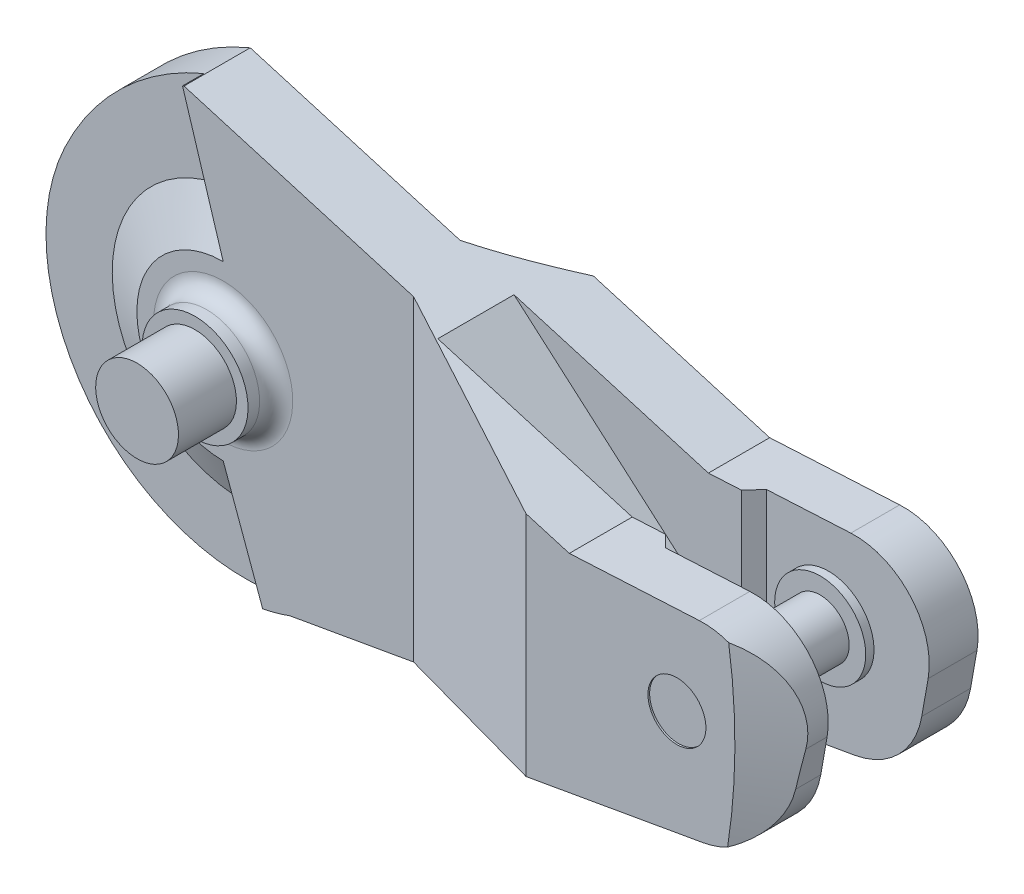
ISO-10303-21;
HEADER;
FILE_DESCRIPTION(('STEP AP214'),'2;1');
FILE_NAME('part.step','',(''),(''),'','','');
FILE_SCHEMA(('AUTOMOTIVE_DESIGN { 1 0 10303 214 1 1 1 1 }'));
ENDSEC;
DATA;
#1=APPLICATION_CONTEXT('core data for automotive mechanical design processes');
#2=APPLICATION_PROTOCOL_DEFINITION('international standard','automotive_design',2000,#1);
#3=PRODUCT_CONTEXT('',#1,'mechanical');
#4=PRODUCT('Part','Part','',(#3));
#5=PRODUCT_RELATED_PRODUCT_CATEGORY('part','',(#4));
#6=PRODUCT_DEFINITION_FORMATION('','',#4);
#7=PRODUCT_DEFINITION_CONTEXT('part definition',#1,'design');
#8=PRODUCT_DEFINITION('design','',#6,#7);
#9=PRODUCT_DEFINITION_SHAPE('','',#8);
#10=(LENGTH_UNIT() NAMED_UNIT(*) SI_UNIT(.MILLI.,.METRE.));
#11=(NAMED_UNIT(*) PLANE_ANGLE_UNIT() SI_UNIT($,.RADIAN.));
#12=(NAMED_UNIT(*) SI_UNIT($,.STERADIAN.) SOLID_ANGLE_UNIT());
#13=UNCERTAINTY_MEASURE_WITH_UNIT(LENGTH_MEASURE(1.E-05),#10,'distance_accuracy_value','');
#14=(GEOMETRIC_REPRESENTATION_CONTEXT(3) GLOBAL_UNCERTAINTY_ASSIGNED_CONTEXT((#13)) GLOBAL_UNIT_ASSIGNED_CONTEXT((#10,
#11,#12)) REPRESENTATION_CONTEXT('',''));
#15=CARTESIAN_POINT('',(0.,0.,0.));
#16=DIRECTION('',(0.,0.,1.));
#17=DIRECTION('',(1.,0.,0.));
#18=AXIS2_PLACEMENT_3D('',#15,#16,#17);
#19=CARTESIAN_POINT('',(370.269104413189,-54.8244192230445,45.));
#20=DIRECTION('',(-0.173648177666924,0.984807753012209,0.));
#21=DIRECTION('',(-0.984807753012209,-0.173648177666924,0.));
#22=AXIS2_PLACEMENT_3D('',#19,#20,#21);
#23=PLANE('',#22);
#24=DIRECTION('',(0.984807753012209,0.173648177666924,0.));
#25=VECTOR('',#24,1.);
#26=CARTESIAN_POINT('',(-206.046620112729,-156.444430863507,-30.));
#27=LINE('',#26,#25);
#28=CARTESIAN_POINT('',(139.916177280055,-95.4418553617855,-30.));
#29=VERTEX_POINT('',#28);
#30=CARTESIAN_POINT('',(335.790613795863,-60.9039073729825,-30.));
#31=VERTEX_POINT('',#30);
#32=EDGE_CURVE('E556',#29,#31,#27,.T.);
#33=ORIENTED_EDGE('',*,*,#32,.T.);
#34=DIRECTION('',(0.,0.,-1.));
#35=VECTOR('',#34,1.);
#36=CARTESIAN_POINT('',(335.790613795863,-60.9039073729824,45.));
#37=LINE('',#36,#35);
#38=CARTESIAN_POINT('',(335.790613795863,-60.9039073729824,-0.5));
#39=VERTEX_POINT('',#38);
#40=EDGE_CURVE('E662',#31,#39,#37,.F.);
#41=ORIENTED_EDGE('',*,*,#40,.T.);
#42=DIRECTION('',(-0.984807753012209,-0.173648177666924,0.));
#43=VECTOR('',#42,1.);
#44=CARTESIAN_POINT('',(370.269104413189,-54.8244192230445,-0.5));
#45=LINE('',#44,#43);
#46=CARTESIAN_POINT('',(310.156435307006,-65.4239046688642,-0.5));
#47=VERTEX_POINT('',#46);
#48=EDGE_CURVE('E799',#39,#47,#45,.T.);
#49=ORIENTED_EDGE('',*,*,#48,.T.);
#50=DIRECTION('',(0.,0.,-1.));
#51=VECTOR('',#50,1.);
#52=CARTESIAN_POINT('',(310.156435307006,-65.4239046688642,60.5));
#53=LINE('',#52,#51);
#54=CARTESIAN_POINT('',(310.156435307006,-65.4239046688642,60.5));
#55=VERTEX_POINT('',#54);
#56=EDGE_CURVE('E814',#55,#47,#53,.T.);
#57=ORIENTED_EDGE('',*,*,#56,.F.);
#58=DIRECTION('',(-0.984807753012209,-0.173648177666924,0.));
#59=VECTOR('',#58,1.);
#60=CARTESIAN_POINT('',(370.269104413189,-54.8244192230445,60.5));
#61=LINE('',#60,#59);
#62=CARTESIAN_POINT('',(335.790613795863,-60.9039073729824,60.5));
#63=VERTEX_POINT('',#62);
#64=EDGE_CURVE('E809',#63,#55,#61,.T.);
#65=ORIENTED_EDGE('',*,*,#64,.F.);
#66=DIRECTION('',(0.,0.,-1.));
#67=VECTOR('',#66,1.);
#68=CARTESIAN_POINT('',(335.790613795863,-60.9039073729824,45.));
#69=LINE('',#68,#67);
#70=CARTESIAN_POINT('',(335.790613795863,-60.9039073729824,91.));
#71=VERTEX_POINT('',#70);
#72=EDGE_CURVE('E671',#63,#71,#69,.F.);
#73=ORIENTED_EDGE('',*,*,#72,.T.);
#74=DIRECTION('',(0.984807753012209,0.173648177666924,0.));
#75=VECTOR('',#74,1.);
#76=CARTESIAN_POINT('',(115.,-99.8352496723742,91.));
#77=LINE('',#76,#75);
#78=CARTESIAN_POINT('',(228.85399525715,-79.7597184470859,91.));
#79=VERTEX_POINT('',#78);
#80=EDGE_CURVE('E571',#79,#71,#77,.T.);
#81=ORIENTED_EDGE('',*,*,#80,.F.);
#82=DIRECTION('',(-0.915035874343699,-0.161345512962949,-0.369698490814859));
#83=VECTOR('',#82,1.);
#84=CARTESIAN_POINT('',(241.984181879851,-77.4445122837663,96.3049397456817));
#85=LINE('',#84,#83);
#86=CARTESIAN_POINT('',(115.,-99.8352496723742,45.));
#87=VERTEX_POINT('',#86);
#88=EDGE_CURVE('E872',#79,#87,#85,.T.);
#89=ORIENTED_EDGE('',*,*,#88,.T.);
#90=DIRECTION('',(0.984807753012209,0.173648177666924,0.));
#91=VECTOR('',#90,1.);
#92=CARTESIAN_POINT('',(192.,-86.258072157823,45.));
#93=LINE('',#92,#91);
#94=CARTESIAN_POINT('',(40.4310129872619,-112.983774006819,45.));
#95=VERTEX_POINT('',#94);
#96=EDGE_CURVE('E906',#95,#87,#93,.T.);
#97=ORIENTED_EDGE('',*,*,#96,.F.);
#98=DIRECTION('',(0.,0.,-1.));
#99=VECTOR('',#98,1.);
#100=CARTESIAN_POINT('',(40.4310129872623,-112.983774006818,45.));
#101=LINE('',#100,#99);
#102=CARTESIAN_POINT('',(40.4310129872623,-112.983774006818,5.));
#103=VERTEX_POINT('',#102);
#104=EDGE_CURVE('E831',#95,#103,#101,.T.);
#105=ORIENTED_EDGE('',*,*,#104,.T.);
#106=DIRECTION('',(0.984807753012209,0.173648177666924,0.));
#107=VECTOR('',#106,1.);
#108=CARTESIAN_POINT('',(370.269104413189,-54.8244192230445,5.));
#109=LINE('',#108,#107);
#110=CARTESIAN_POINT('',(94.2889517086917,-103.487166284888,5.));
#111=VERTEX_POINT('',#110);
#112=EDGE_CURVE('E828',#103,#111,#109,.T.);
#113=ORIENTED_EDGE('',*,*,#112,.T.);
#114=CARTESIAN_POINT('',(-59.6867080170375,-130.637229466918,0.678033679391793));
#115=CARTESIAN_POINT('',(-58.7487078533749,-130.471834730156,1.32185919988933));
#116=CARTESIAN_POINT('',(-57.8072202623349,-130.305825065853,1.96043620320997));
#117=CARTESIAN_POINT('',(-55.9169405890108,-129.972517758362,3.22639204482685));
#118=CARTESIAN_POINT('',(-54.9681483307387,-129.805220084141,3.85377061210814));
#119=CARTESIAN_POINT('',(-52.1099433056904,-129.301241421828,5.71830089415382));
#120=CARTESIAN_POINT('',(-50.1891402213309,-128.962552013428,6.93754573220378));
#121=CARTESIAN_POINT('',(-46.3064712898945,-128.277932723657,9.32673529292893));
#122=CARTESIAN_POINT('',(-44.3444625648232,-127.931977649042,10.4964410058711));
#123=CARTESIAN_POINT('',(-40.3854070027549,-127.233889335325,12.7728880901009));
#124=CARTESIAN_POINT('',(-38.388362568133,-126.881756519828,13.8796337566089));
#125=CARTESIAN_POINT('',(-34.3136729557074,-126.163278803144,16.0441870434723));
#126=CARTESIAN_POINT('',(-32.2352181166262,-125.79679113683,17.1004287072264));
#127=CARTESIAN_POINT('',(-28.0376572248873,-125.05664789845,19.12677131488));
#128=CARTESIAN_POINT('',(-25.9185488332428,-124.682991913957,20.0968672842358));
#129=CARTESIAN_POINT('',(-21.6424492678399,-123.929000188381,21.9369119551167));
#130=CARTESIAN_POINT('',(-19.4855247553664,-123.548676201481,22.8070197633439));
#131=CARTESIAN_POINT('',(-15.1311325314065,-122.780879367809,24.4352790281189));
#132=CARTESIAN_POINT('',(-12.933671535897,-122.393407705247,25.1934488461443));
#133=CARTESIAN_POINT('',(-9.30540251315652,-121.753645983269,26.3313483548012));
#134=CARTESIAN_POINT('',(-7.88592383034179,-121.503353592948,26.7485345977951));
#135=CARTESIAN_POINT('',(-5.0325002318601,-121.000218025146,27.528189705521));
#136=CARTESIAN_POINT('',(-3.59855633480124,-120.747375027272,27.890662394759));
#137=CARTESIAN_POINT('',(-0.717433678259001,-120.239355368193,28.5574854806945));
#138=CARTESIAN_POINT('',(0.729746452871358,-119.98417846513,28.8618297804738));
#139=CARTESIAN_POINT('',(3.63536004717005,-119.471840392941,29.4091938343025));
#140=CARTESIAN_POINT('',(5.0937935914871,-119.214679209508,29.6522131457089));
#141=CARTESIAN_POINT('',(8.00702147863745,-118.700998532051,30.0723918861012));
#142=CARTESIAN_POINT('',(9.46173864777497,-118.444492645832,30.2501014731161));
#143=CARTESIAN_POINT('',(12.3774650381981,-117.930371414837,30.5405219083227));
#144=CARTESIAN_POINT('',(13.8384742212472,-117.672756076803,30.6532331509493));
#145=CARTESIAN_POINT('',(16.7639494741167,-117.156915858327,30.8122961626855));
#146=CARTESIAN_POINT('',(18.2284154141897,-116.898691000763,30.8586503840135));
#147=CARTESIAN_POINT('',(21.1579228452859,-116.382139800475,30.8844362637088));
#148=CARTESIAN_POINT('',(22.6229643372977,-116.123813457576,30.8638678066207));
#149=CARTESIAN_POINT('',(25.5549970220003,-115.606816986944,30.755902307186));
#150=CARTESIAN_POINT('',(27.0219811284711,-115.348148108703,30.6683074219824));
#151=CARTESIAN_POINT('',(29.9506616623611,-114.831742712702,30.4271263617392));
#152=CARTESIAN_POINT('',(31.412358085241,-114.574006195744,30.2735401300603));
#153=CARTESIAN_POINT('',(34.3278337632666,-114.059929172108,29.9021935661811));
#154=CARTESIAN_POINT('',(35.7816128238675,-113.803588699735,29.6844316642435));
#155=CARTESIAN_POINT('',(38.6788733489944,-113.292723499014,29.1871917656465));
#156=CARTESIAN_POINT('',(40.1223547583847,-113.038198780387,28.9077134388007));
#157=CARTESIAN_POINT('',(43.0026875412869,-112.530318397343,28.2887811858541));
#158=CARTESIAN_POINT('',(44.4394905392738,-112.276971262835,27.9490957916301));
#159=CARTESIAN_POINT('',(47.2991084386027,-111.772743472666,27.213848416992));
#160=CARTESIAN_POINT('',(48.7219234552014,-111.521862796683,26.8182868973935));
#161=CARTESIAN_POINT('',(51.5524602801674,-111.022762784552,25.9748155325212));
#162=CARTESIAN_POINT('',(52.9601814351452,-110.774543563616,25.5269034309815));
#163=CARTESIAN_POINT('',(55.7597172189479,-110.280909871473,24.5823599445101));
#164=CARTESIAN_POINT('',(57.1515307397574,-110.035495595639,24.0857251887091));
#165=CARTESIAN_POINT('',(60.9405073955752,-109.367396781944,22.6639374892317));
#166=CARTESIAN_POINT('',(63.3211547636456,-108.9476244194,21.6931494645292));
#167=CARTESIAN_POINT('',(68.032399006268,-108.116904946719,19.6333507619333));
#168=CARTESIAN_POINT('',(70.3629862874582,-107.705959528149,18.5443176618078));
#169=CARTESIAN_POINT('',(74.9769240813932,-106.892397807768,16.2636880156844));
#170=CARTESIAN_POINT('',(77.2602382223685,-106.489787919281,15.0720158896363));
#171=CARTESIAN_POINT('',(81.7801920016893,-105.692798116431,12.6012868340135));
#172=CARTESIAN_POINT('',(84.0168339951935,-105.298417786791,11.3222343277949));
#173=CARTESIAN_POINT('',(88.4654906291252,-104.513999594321,8.67787178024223));
#174=CARTESIAN_POINT('',(90.6771352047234,-104.124026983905,7.3119218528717));
#175=CARTESIAN_POINT('',(95.0597006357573,-103.351262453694,4.51439910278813));
#176=CARTESIAN_POINT('',(97.2306211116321,-102.968470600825,3.08282566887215));
#177=CARTESIAN_POINT('',(101.534131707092,-102.209645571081,0.163816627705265));
#178=CARTESIAN_POINT('',(103.666740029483,-101.83360918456,-1.32359135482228));
#179=CARTESIAN_POINT('',(106.840117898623,-101.274057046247,-3.59137335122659));
#180=CARTESIAN_POINT('',(107.893657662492,-101.088289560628,-4.35341453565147));
#181=CARTESIAN_POINT('',(109.99264407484,-100.71818162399,-5.88892567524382));
#182=CARTESIAN_POINT('',(111.038090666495,-100.533841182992,-6.66239571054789));
#183=CARTESIAN_POINT('',(113.608863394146,-100.080544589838,-8.58456736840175));
#184=CARTESIAN_POINT('',(115.12972906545,-99.8123749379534,-9.73942257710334));
#185=CARTESIAN_POINT('',(118.155958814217,-99.2787689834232,-12.0699179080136));
#186=CARTESIAN_POINT('',(119.661322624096,-99.0133327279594,-13.2455583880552));
#187=CARTESIAN_POINT('',(122.657671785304,-98.4849955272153,-15.6157585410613));
#188=CARTESIAN_POINT('',(124.14865626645,-98.2220947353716,-16.8103193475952));
#189=CARTESIAN_POINT('',(127.117149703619,-97.6986692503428,-19.2166006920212));
#190=CARTESIAN_POINT('',(128.594658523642,-97.438144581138,-20.4283214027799));
#191=CARTESIAN_POINT('',(131.537525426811,-96.9192377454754,-22.8677558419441));
#192=CARTESIAN_POINT('',(133.002879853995,-96.6608562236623,-24.0954741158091));
#193=CARTESIAN_POINT('',(135.921847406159,-96.1461634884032,-26.5652263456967));
#194=CARTESIAN_POINT('',(137.375460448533,-95.8898522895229,-27.8072604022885));
#195=CARTESIAN_POINT('',(141.719767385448,-95.1238337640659,-31.5529141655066));
#196=CARTESIAN_POINT('',(144.59404942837,-94.6170202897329,-34.0761855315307));
#197=CARTESIAN_POINT('',(150.30970024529,-93.6091968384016,-39.1717337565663));
#198=CARTESIAN_POINT('',(153.15099655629,-93.108199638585,-41.7440942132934));
#199=CARTESIAN_POINT('',(158.799889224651,-92.1121474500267,-46.9266847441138));
#200=CARTESIAN_POINT('',(161.60748539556,-91.6170924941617,-49.5369150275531));
#201=CARTESIAN_POINT('',(167.1925297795,-90.6322984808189,-54.7894742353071));
#202=CARTESIAN_POINT('',(169.969982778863,-90.1425585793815,-57.4317979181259));
#203=CARTESIAN_POINT('',(175.498630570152,-89.167708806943,-62.7445827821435));
#204=CARTESIAN_POINT('',(178.249825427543,-88.6825989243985,-65.4150438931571));
#205=CARTESIAN_POINT('',(183.567623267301,-87.7449276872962,-70.6225558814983));
#206=CARTESIAN_POINT('',(186.135558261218,-87.2921314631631,-73.1582054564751));
#207=CARTESIAN_POINT('',(191.252899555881,-86.3898061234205,-78.2486984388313));
#208=CARTESIAN_POINT('',(193.802305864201,-85.9402770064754,-80.8035418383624));
#209=CARTESIAN_POINT('',(198.884558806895,-85.0441386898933,-85.9303912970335));
#210=CARTESIAN_POINT('',(201.417404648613,-84.5975296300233,-88.5023981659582));
#211=CARTESIAN_POINT('',(206.468028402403,-83.7069683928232,-93.6616134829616));
#212=CARTESIAN_POINT('',(208.985806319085,-83.2630162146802,-96.2488219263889));
#213=CARTESIAN_POINT('',(213.99678566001,-82.3794453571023,-101.425569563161));
#214=CARTESIAN_POINT('',(216.49004635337,-81.9398162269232,-104.015049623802));
#215=CARTESIAN_POINT('',(221.464268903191,-81.0627265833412,-109.206163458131));
#216=CARTESIAN_POINT('',(223.945230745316,-80.6252660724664,-111.807797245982));
#217=CARTESIAN_POINT('',(228.895686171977,-79.7523672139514,-117.021757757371));
#218=CARTESIAN_POINT('',(231.365180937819,-79.3169286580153,-119.634083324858));
#219=CARTESIAN_POINT('',(236.293895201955,-78.4478633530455,-124.868685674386));
#220=CARTESIAN_POINT('',(238.753114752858,-78.0142365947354,-127.490962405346));
#221=CARTESIAN_POINT('',(241.207674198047,-77.5814315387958,-130.117721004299));
#222=B_SPLINE_CURVE_WITH_KNOTS('',3,(#114,#115,#116,#117,#118,#119,#120,#121,#122,#123,#124,
#125,#126,#127,#128,#129,#130,#131,#132,#133,#134,#135,#136,#137,#138,#139,#140,#141,#142,#143,
#144,#145,#146,#147,#148,#149,#150,#151,#152,#153,#154,#155,#156,#157,#158,#159,#160,#161,#162,
#163,#164,#165,#166,#167,#168,#169,#170,#171,#172,#173,#174,#175,#176,#177,#178,#179,#180,#181,
#182,#183,#184,#185,#186,#187,#188,#189,#190,#191,#192,#193,#194,#195,#196,#197,#198,#199,#200,
#201,#202,#203,#204,#205,#206,#207,#208,#209,#210,#211,#212,#213,#214,#215,#216,#217,#218,#219,
#220,#221),.UNSPECIFIED.,.F.,.F.,(4,2,2,2,2,2,2,2,2,2,2,2,2,2,2,2,2,2,2,2,2,2,2,2,2,2,2,2,2,2,2,
2,2,2,2,2,2,2,2,2,2,2,2,2,2,2,2,2,2,2,2,2,2,4),(0.,3.44893741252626,6.89795818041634,
13.7976110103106,20.7274480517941,27.6568117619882,34.7353143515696,41.8142254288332,
48.8817114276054,55.9480368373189,60.4487137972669,64.9490760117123,69.4499099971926,
73.9507764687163,78.4128087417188,82.8748139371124,87.3366542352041,91.7985022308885,
96.2735713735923,100.748644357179,105.223826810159,109.699033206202,114.191833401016,
118.684596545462,123.177553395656,127.670821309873,135.481922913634,143.294508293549,
151.112896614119,158.930889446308,166.815227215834,174.69963843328,182.580198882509,
186.52050114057,190.460831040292,196.245758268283,202.030785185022,207.816160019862,
213.601593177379,219.388707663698,225.17586282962,236.749699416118,248.345407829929,
259.941180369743,271.535083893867,283.12895850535,294.040288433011,304.951613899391,
315.863457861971,326.775298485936,337.639656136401,348.504026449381,359.36725154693,
370.230420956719),.UNSPECIFIED.);
#223=EDGE_CURVE('E518',#111,#29,#222,.T.);
#224=ORIENTED_EDGE('',*,*,#223,.T.);
#225=EDGE_LOOP('',(#33,#41,#49,#57,#65,#73,#81,#89,#97,#105,#113,#224));
#226=FACE_BOUND('',#225,.T.);
#227=DIRECTION('',(0.,0.,1.));
#228=VECTOR('',#227,1.);
#229=CARTESIAN_POINT('',(274.264881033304,-71.75255406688,43.5));
#230=LINE('',#229,#228);
#231=CARTESIAN_POINT('',(274.264881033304,-71.75255406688,-16.5));
#232=VERTEX_POINT('',#231);
#233=CARTESIAN_POINT('',(274.264881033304,-71.75255406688,43.5));
#234=VERTEX_POINT('',#233);
#235=EDGE_CURVE('E301',#232,#234,#230,.T.);
#236=ORIENTED_EDGE('',*,*,#235,.F.);
#237=DIRECTION('',(0.984807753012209,0.173648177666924,0.));
#238=VECTOR('',#237,1.);
#239=CARTESIAN_POINT('',(274.264881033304,-71.75255406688,-16.5));
#240=LINE('',#239,#238);
#241=CARTESIAN_POINT('',(220.100454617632,-81.3032038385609,-16.5));
#242=VERTEX_POINT('',#241);
#243=EDGE_CURVE('E303',#242,#232,#240,.T.);
#244=ORIENTED_EDGE('',*,*,#243,.F.);
#245=DIRECTION('',(0.,0.,-1.));
#246=VECTOR('',#245,1.);
#247=CARTESIAN_POINT('',(220.100454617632,-81.3032038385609,43.5));
#248=LINE('',#247,#246);
#249=CARTESIAN_POINT('',(220.100454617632,-81.3032038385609,43.5));
#250=VERTEX_POINT('',#249);
#251=EDGE_CURVE('E38',#250,#242,#248,.T.);
#252=ORIENTED_EDGE('',*,*,#251,.F.);
#253=DIRECTION('',(-0.984807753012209,-0.173648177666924,0.));
#254=VECTOR('',#253,1.);
#255=CARTESIAN_POINT('',(274.264881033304,-71.75255406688,43.5));
#256=LINE('',#255,#254);
#257=EDGE_CURVE('E33',#234,#250,#256,.T.);
#258=ORIENTED_EDGE('',*,*,#257,.F.);
#259=EDGE_LOOP('',(#236,#244,#252,#258));
#260=FACE_BOUND('',#259,.T.);
#261=ADVANCED_FACE('F17',(#226,#260),#23,.F.);
#262=CARTESIAN_POINT('',(320.,0.,45.));
#263=DIRECTION('',(0.,0.,-1.));
#264=DIRECTION('',(-1.,0.,0.));
#265=AXIS2_PLACEMENT_3D('',#262,#263,#264);
#266=CYLINDRICAL_SURFACE('',#265,17.5);
#267=CARTESIAN_POINT('',(320.,0.,91.));
#268=DIRECTION('',(0.,0.,1.));
#269=DIRECTION('',(1.,0.,0.));
#270=AXIS2_PLACEMENT_3D('',#267,#268,#269);
#271=CIRCLE('',#270,17.5);
#272=CARTESIAN_POINT('',(337.5,0.,91.));
#273=VERTEX_POINT('',#272);
#274=EDGE_CURVE('E565',#273,#273,#271,.T.);
#275=ORIENTED_EDGE('',*,*,#274,.T.);
#276=EDGE_LOOP('',(#275));
#277=FACE_BOUND('',#276,.T.);
#278=CARTESIAN_POINT('',(320.,0.,90.));
#279=DIRECTION('',(0.,0.,-1.));
#280=DIRECTION('',(-1.,0.,0.));
#281=AXIS2_PLACEMENT_3D('',#278,#279,#280);
#282=CIRCLE('',#281,17.5);
#283=CARTESIAN_POINT('',(302.5,0.,90.));
#284=VERTEX_POINT('',#283);
#285=EDGE_CURVE('E333',#284,#284,#282,.T.);
#286=ORIENTED_EDGE('',*,*,#285,.T.);
#287=EDGE_LOOP('',(#286));
#288=FACE_BOUND('',#287,.T.);
#289=ADVANCED_FACE('F648',(#277,#288),#266,.F.);
#290=CARTESIAN_POINT('',(209.128944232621,52.1064744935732,-35.));
#291=DIRECTION('',(-0.984807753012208,-0.17364817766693,0.));
#292=DIRECTION('',(0.17364817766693,-0.984807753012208,0.));
#293=AXIS2_PLACEMENT_3D('',#290,#291,#292);
#294=PLANE('',#293);
#295=DIRECTION('',(0.17364817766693,-0.984807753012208,0.));
#296=VECTOR('',#295,1.);
#297=CARTESIAN_POINT('',(209.128944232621,52.1064744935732,-31.5));
#298=LINE('',#297,#296);
#299=CARTESIAN_POINT('',(209.128944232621,52.1064744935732,-31.5));
#300=VERTEX_POINT('',#299);
#301=CARTESIAN_POINT('',(214.338389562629,22.5622419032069,-31.5));
#302=VERTEX_POINT('',#301);
#303=EDGE_CURVE('E398',#300,#302,#298,.T.);
#304=ORIENTED_EDGE('',*,*,#303,.F.);
#305=DIRECTION('',(0.,0.,1.));
#306=VECTOR('',#305,1.);
#307=CARTESIAN_POINT('',(209.128944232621,52.1064744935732,-35.));
#308=LINE('',#307,#306);
#309=CARTESIAN_POINT('',(209.128944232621,52.1064744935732,-30.));
#310=VERTEX_POINT('',#309);
#311=EDGE_CURVE('E765',#300,#310,#308,.T.);
#312=ORIENTED_EDGE('',*,*,#311,.T.);
#313=DIRECTION('',(0.17364817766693,-0.984807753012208,0.));
#314=VECTOR('',#313,1.);
#315=CARTESIAN_POINT('',(209.128944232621,52.1064744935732,-30.));
#316=LINE('',#315,#314);
#317=CARTESIAN_POINT('',(214.338389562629,22.562241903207,-30.));
#318=VERTEX_POINT('',#317);
#319=EDGE_CURVE('E944',#310,#318,#316,.T.);
#320=ORIENTED_EDGE('',*,*,#319,.T.);
#321=DIRECTION('',(0.,0.,1.));
#322=VECTOR('',#321,1.);
#323=CARTESIAN_POINT('',(214.338389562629,22.5622419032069,-35.));
#324=LINE('',#323,#322);
#325=EDGE_CURVE('E770',#302,#318,#324,.T.);
#326=ORIENTED_EDGE('',*,*,#325,.F.);
#327=EDGE_LOOP('',(#304,#312,#320,#326));
#328=FACE_BOUND('',#327,.T.);
#329=ADVANCED_FACE('F654',(#328),#294,.F.);
#330=CARTESIAN_POINT('',(390.,57.0750502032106,45.));
#331=DIRECTION('',(-0.984807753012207,0.173648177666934,0.));
#332=DIRECTION('',(-0.173648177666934,-0.984807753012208,0.));
#333=AXIS2_PLACEMENT_3D('',#330,#331,#332);
#334=PLANE('',#333);
#335=CARTESIAN_POINT('',(376.348557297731,-20.3461286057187,75.6667632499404));
#336=CARTESIAN_POINT('',(376.668167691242,-18.5335279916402,75.5118139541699));
#337=CARTESIAN_POINT('',(376.987642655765,-16.721695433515,75.3476206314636));
#338=CARTESIAN_POINT('',(377.626261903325,-13.0999057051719,75.0009436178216));
#339=CARTESIAN_POINT('',(377.945406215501,-11.2899483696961,74.8184617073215));
#340=CARTESIAN_POINT('',(378.583366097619,-7.67189808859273,74.4353752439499));
#341=CARTESIAN_POINT('',(378.902181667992,-5.86380514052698,74.234770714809));
#342=CARTESIAN_POINT('',(379.539488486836,-2.24945856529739,73.8156220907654));
#343=CARTESIAN_POINT('',(379.857979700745,-0.443205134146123,73.597076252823));
#344=CARTESIAN_POINT('',(380.176279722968,1.36196399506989,73.3696709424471));
#345=B_SPLINE_CURVE_WITH_KNOTS('',3,(#335,#336,#337,#338,#339,#340,#341,#342,#343,#344),
.UNSPECIFIED.,.F.,.F.,(4,2,2,2,4),(0.,5.54119525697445,11.0818515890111,16.622500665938,
22.163688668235),.UNSPECIFIED.);
#346=CARTESIAN_POINT('',(376.348592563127,-20.3459286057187,75.6667461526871));
#347=VERTEX_POINT('',#346);
#348=CARTESIAN_POINT('',(380.176244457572,1.36176399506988,73.3696961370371));
#349=VERTEX_POINT('',#348);
#350=EDGE_CURVE('E421',#347,#349,#345,.T.);
#351=ORIENTED_EDGE('',*,*,#350,.F.);
#352=DIRECTION('',(0.,0.,-1.));
#353=VECTOR('',#352,1.);
#354=CARTESIAN_POINT('',(376.348592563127,-20.3459286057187,45.));
#355=LINE('',#354,#353);
#356=CARTESIAN_POINT('',(376.348592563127,-20.3459286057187,60.5));
#357=VERTEX_POINT('',#356);
#358=EDGE_CURVE('E673',#347,#357,#355,.T.);
#359=ORIENTED_EDGE('',*,*,#358,.T.);
#360=DIRECTION('',(-0.173648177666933,-0.984807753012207,0.));
#361=VECTOR('',#360,1.);
#362=CARTESIAN_POINT('',(370.269104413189,-54.8244192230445,60.5));
#363=LINE('',#362,#361);
#364=CARTESIAN_POINT('',(380.176244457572,1.36176399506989,60.5));
#365=VERTEX_POINT('',#364);
#366=EDGE_CURVE('E806',#365,#357,#363,.T.);
#367=ORIENTED_EDGE('',*,*,#366,.F.);
#368=DIRECTION('',(0.,0.,-1.));
#369=VECTOR('',#368,1.);
#370=CARTESIAN_POINT('',(380.176244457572,1.36176399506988,45.));
#371=LINE('',#370,#369);
#372=EDGE_CURVE('E856',#365,#349,#371,.F.);
#373=ORIENTED_EDGE('',*,*,#372,.T.);
#374=EDGE_LOOP('',(#351,#359,#367,#373));
#375=FACE_BOUND('',#374,.T.);
#376=ADVANCED_FACE('F711',(#375),#334,.F.);
#377=CARTESIAN_POINT('',(335.859895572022,9.17593199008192,45.));
#378=DIRECTION('',(0.,0.,-1.));
#379=DIRECTION('',(-1.,0.,0.));
#380=AXIS2_PLACEMENT_3D('',#377,#378,#379);
#381=CYLINDRICAL_SURFACE('',#380,45.);
#382=CARTESIAN_POINT('',(335.859895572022,9.17593199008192,91.));
#383=DIRECTION('',(0.,0.,1.));
#384=DIRECTION('',(1.,0.,0.));
#385=AXIS2_PLACEMENT_3D('',#382,#383,#384);
#386=CIRCLE('',#385,45.);
#387=CARTESIAN_POINT('',(351.250089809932,51.4623591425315,91.));
#388=VERTEX_POINT('',#387);
#389=CARTESIAN_POINT('',(333.50477754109,54.1142610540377,91.));
#390=VERTEX_POINT('',#389);
#391=EDGE_CURVE('E574',#388,#390,#386,.T.);
#392=ORIENTED_EDGE('',*,*,#391,.F.);
#393=CARTESIAN_POINT('',(351.24978487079,51.4624701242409,91.0002));
#394=CARTESIAN_POINT('',(352.459398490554,51.0222652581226,90.2068230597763));
#395=CARTESIAN_POINT('',(353.657662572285,50.5273538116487,89.4258098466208));
#396=CARTESIAN_POINT('',(356.023185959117,49.4269496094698,87.8931169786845));
#397=CARTESIAN_POINT('',(357.19042043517,48.8213711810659,87.1414606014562));
#398=CARTESIAN_POINT('',(359.49443695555,47.4929386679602,85.6664439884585));
#399=CARTESIAN_POINT('',(360.630830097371,46.7690366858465,84.9434157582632));
#400=CARTESIAN_POINT('',(362.850565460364,45.2084770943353,83.5393610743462));
#401=CARTESIAN_POINT('',(363.933919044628,44.3718437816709,82.8583256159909));
#402=CARTESIAN_POINT('',(366.041676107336,42.5822164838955,81.5410483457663));
#403=CARTESIAN_POINT('',(367.065756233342,41.6286592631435,80.9050486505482));
#404=CARTESIAN_POINT('',(368.543211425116,40.1161712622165,79.9929461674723));
#405=CARTESIAN_POINT('',(369.026023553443,39.5981876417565,79.6958311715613));
#406=CARTESIAN_POINT('',(369.970454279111,38.5353409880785,79.1164478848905));
#407=CARTESIAN_POINT('',(370.432075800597,37.9904816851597,78.834177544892));
#408=CARTESIAN_POINT('',(371.330729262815,36.8766564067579,78.286431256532));
#409=CARTESIAN_POINT('',(371.767847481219,36.3077892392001,78.02089591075));
#410=CARTESIAN_POINT('',(372.617601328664,35.1449428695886,77.5064138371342));
#411=CARTESIAN_POINT('',(373.030240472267,34.5509672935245,77.2574647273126));
#412=CARTESIAN_POINT('',(373.82932322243,33.3389081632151,76.7770680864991));
#413=CARTESIAN_POINT('',(374.215769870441,32.7208274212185,76.5456185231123));
#414=CARTESIAN_POINT('',(374.96079037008,31.4616913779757,76.1011098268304));
#415=CARTESIAN_POINT('',(375.31936554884,30.8206371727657,75.8880498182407));
#416=CARTESIAN_POINT('',(375.957858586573,29.6100327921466,75.5102636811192));
#417=CARTESIAN_POINT('',(376.241696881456,29.0433432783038,75.3429800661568));
#418=CARTESIAN_POINT('',(376.786657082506,27.8950159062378,75.0231054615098));
#419=CARTESIAN_POINT('',(377.047777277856,27.3133769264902,74.8705155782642));
#420=CARTESIAN_POINT('',(377.546257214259,26.1363472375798,74.5805801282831));
#421=CARTESIAN_POINT('',(377.783619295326,25.5409578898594,74.4432330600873));
#422=CARTESIAN_POINT('',(378.233676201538,24.3375735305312,74.1842549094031));
#423=CARTESIAN_POINT('',(378.446371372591,23.7295786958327,74.0626236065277));
#424=CARTESIAN_POINT('',(378.846270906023,22.5021552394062,73.8355022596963));
#425=CARTESIAN_POINT('',(379.033470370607,21.8827244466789,73.7300153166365));
#426=CARTESIAN_POINT('',(379.381525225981,20.6340215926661,73.5356259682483));
#427=CARTESIAN_POINT('',(379.542383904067,20.0047507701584,73.4467214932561));
#428=CARTESIAN_POINT('',(379.837094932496,18.7377766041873,73.2858325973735));
#429=CARTESIAN_POINT('',(379.970947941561,18.1000734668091,73.2138477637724));
#430=CARTESIAN_POINT('',(380.211068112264,16.8178631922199,73.0870878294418));
#431=CARTESIAN_POINT('',(380.317335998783,16.1733562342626,73.0323122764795));
#432=CARTESIAN_POINT('',(380.576489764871,14.3551478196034,72.9029177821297));
#433=CARTESIAN_POINT('',(380.697506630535,13.175279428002,72.8481130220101));
#434=CARTESIAN_POINT('',(380.845901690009,10.8084401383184,72.7964245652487));
#435=CARTESIAN_POINT('',(380.873285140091,9.6214696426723,72.7995376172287));
#436=CARTESIAN_POINT('',(380.844052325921,7.84187327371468,72.8475996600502));
#437=CARTESIAN_POINT('',(380.822495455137,7.24783159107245,72.8709274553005));
#438=CARTESIAN_POINT('',(380.755937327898,6.06175881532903,72.9320362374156));
#439=CARTESIAN_POINT('',(380.710935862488,5.4697277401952,72.9698173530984));
#440=CARTESIAN_POINT('',(380.597674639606,4.28891530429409,73.0597145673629));
#441=CARTESIAN_POINT('',(380.529411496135,3.70013442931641,73.1118327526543));
#442=CARTESIAN_POINT('',(380.369940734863,2.52713123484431,73.2302145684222));
#443=CARTESIAN_POINT('',(380.278733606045,1.94290881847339,73.2964778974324));
#444=CARTESIAN_POINT('',(380.17620919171,1.36156399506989,73.3697213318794));
#445=B_SPLINE_CURVE_WITH_KNOTS('',3,(#393,#394,#395,#396,#397,#398,#399,#400,#401,#402,#403,
#404,#405,#406,#407,#408,#409,#410,#411,#412,#413,#414,#415,#416,#417,#418,#419,#420,#421,#422,
#423,#424,#425,#426,#427,#428,#429,#430,#431,#432,#433,#434,#435,#436,#437,#438,#439,#440,#441,
#442,#443,#444),.UNSPECIFIED.,.F.,.F.,(4,2,2,2,2,2,2,2,2,2,2,2,2,2,2,2,2,2,2,2,2,2,2,2,2,4),(0.,
4.53570066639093,9.07492762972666,13.6567811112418,18.2376486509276,22.8415201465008,
25.1445182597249,27.4471976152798,29.7411810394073,32.0348343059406,34.3282207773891,
36.6214979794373,38.5873124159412,40.5532747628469,42.5190432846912,44.4847842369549,
46.4509022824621,48.4167747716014,50.3825993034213,52.3483721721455,55.9049674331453,
59.4613630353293,61.2454984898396,63.029649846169,64.8140610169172,66.598434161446),.UNSPECIFIED.);
#446=EDGE_CURVE('E428',#388,#349,#445,.T.);
#447=ORIENTED_EDGE('',*,*,#446,.T.);
#448=ORIENTED_EDGE('',*,*,#372,.F.);
#449=CARTESIAN_POINT('',(335.859895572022,9.17593199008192,60.5));
#450=DIRECTION('',(0.,0.,-1.));
#451=DIRECTION('',(-1.,0.,0.));
#452=AXIS2_PLACEMENT_3D('',#449,#450,#451);
#453=CIRCLE('',#452,45.);
#454=CARTESIAN_POINT('',(333.50477754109,54.1142610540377,60.5));
#455=VERTEX_POINT('',#454);
#456=EDGE_CURVE('E804',#455,#365,#453,.T.);
#457=ORIENTED_EDGE('',*,*,#456,.F.);
#458=DIRECTION('',(0.,0.,-1.));
#459=VECTOR('',#458,1.);
#460=CARTESIAN_POINT('',(333.50477754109,54.1142610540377,45.));
#461=LINE('',#460,#459);
#462=EDGE_CURVE('E909',#390,#455,#461,.T.);
#463=ORIENTED_EDGE('',*,*,#462,.F.);
#464=EDGE_LOOP('',(#392,#447,#448,#457,#463));
#465=FACE_BOUND('',#464,.T.);
#466=ADVANCED_FACE('F625',(#465),#381,.T.);
#467=CARTESIAN_POINT('',(335.859895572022,9.17593199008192,91.));
#468=DIRECTION('',(0.,0.,1.));
#469=DIRECTION('',(1.,0.,0.));
#470=AXIS2_PLACEMENT_3D('',#467,#468,#469);
#471=PLANE('',#470);
#472=ORIENTED_EDGE('',*,*,#274,.F.);
#473=EDGE_LOOP('',(#472));
#474=FACE_BOUND('',#473,.T.);
#475=CARTESIAN_POINT('',(327.108204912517,-11.663519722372,91.));
#476=DIRECTION('',(0.,0.,1.));
#477=DIRECTION('',(1.,0.,0.));
#478=AXIS2_PLACEMENT_3D('',#475,#476,#477);
#479=CIRCLE('',#478,50.);
#480=CARTESIAN_POINT('',(350.585766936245,-55.8087808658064,91.));
#481=VERTEX_POINT('',#480);
#482=EDGE_CURVE('E680',#71,#481,#479,.T.);
#483=ORIENTED_EDGE('',*,*,#482,.T.);
#484=CARTESIAN_POINT('',(0.,0.,91.));
#485=DIRECTION('',(0.,0.,1.));
#486=DIRECTION('',(1.,0.,0.));
#487=AXIS2_PLACEMENT_3D('',#484,#485,#486);
#488=CIRCLE('',#487,355.);
#489=EDGE_CURVE('E416',#481,#388,#488,.T.);
#490=ORIENTED_EDGE('',*,*,#489,.T.);
#491=ORIENTED_EDGE('',*,*,#391,.T.);
#492=DIRECTION('',(-0.998629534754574,-0.0523359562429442,0.));
#493=VECTOR('',#492,1.);
#494=CARTESIAN_POINT('',(333.50477754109,54.1142610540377,91.));
#495=LINE('',#494,#493);
#496=CARTESIAN_POINT('',(255.,50.,91.));
#497=VERTEX_POINT('',#496);
#498=EDGE_CURVE('E576',#390,#497,#495,.T.);
#499=ORIENTED_EDGE('',*,*,#498,.T.);
#500=DIRECTION('',(-0.959268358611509,0.282496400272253,0.));
#501=VECTOR('',#500,1.);
#502=CARTESIAN_POINT('',(255.,50.,91.));
#503=LINE('',#502,#501);
#504=CARTESIAN_POINT('',(228.85399525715,57.6997767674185,91.));
#505=VERTEX_POINT('',#504);
#506=EDGE_CURVE('E824',#497,#505,#503,.T.);
#507=ORIENTED_EDGE('',*,*,#506,.T.);
#508=DIRECTION('',(0.,-1.,0.));
#509=VECTOR('',#508,1.);
#510=CARTESIAN_POINT('',(228.85399525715,-99.8352496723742,91.));
#511=LINE('',#510,#509);
#512=EDGE_CURVE('E869',#505,#79,#511,.T.);
#513=ORIENTED_EDGE('',*,*,#512,.T.);
#514=ORIENTED_EDGE('',*,*,#80,.T.);
#515=EDGE_LOOP('',(#483,#490,#491,#499,#507,#513,#514));
#516=FACE_BOUND('',#515,.T.);
#517=ADVANCED_FACE('F468',(#474,#516),#471,.T.);
#518=CARTESIAN_POINT('',(327.108204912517,-11.663519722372,45.));
#519=DIRECTION('',(0.,0.,-1.));
#520=DIRECTION('',(-1.,0.,0.));
#521=AXIS2_PLACEMENT_3D('',#518,#519,#520);
#522=CYLINDRICAL_SURFACE('',#521,50.);
#523=ORIENTED_EDGE('',*,*,#358,.F.);
#524=CARTESIAN_POINT('',(376.348627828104,-20.3457286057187,75.666729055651));
#525=CARTESIAN_POINT('',(376.235443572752,-20.9877294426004,75.7216018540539));
#526=CARTESIAN_POINT('',(376.109789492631,-21.6268602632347,75.7841294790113));
#527=CARTESIAN_POINT('',(375.834032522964,-22.8981249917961,75.9242611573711));
#528=CARTESIAN_POINT('',(375.683930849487,-23.5302592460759,76.0018644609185));
#529=CARTESIAN_POINT('',(375.359844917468,-24.7860019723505,76.1718742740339));
#530=CARTESIAN_POINT('',(375.185873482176,-25.4096148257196,76.2642728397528));
#531=CARTESIAN_POINT('',(374.814592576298,-26.6474537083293,76.4636071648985));
#532=CARTESIAN_POINT('',(374.617282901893,-27.2616796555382,76.5705430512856));
#533=CARTESIAN_POINT('',(373.994485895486,-29.0792446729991,76.910949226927));
#534=CARTESIAN_POINT('',(373.535540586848,-30.2674557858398,77.1653762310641));
#535=CARTESIAN_POINT('',(372.533839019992,-32.5947824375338,77.7274782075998));
#536=CARTESIAN_POINT('',(371.991074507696,-33.7338931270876,78.0351584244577));
#537=CARTESIAN_POINT('',(370.829082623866,-35.954509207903,78.6999961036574));
#538=CARTESIAN_POINT('',(370.209995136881,-37.0361149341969,79.0570631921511));
#539=CARTESIAN_POINT('',(368.901282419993,-39.138454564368,79.8176899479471));
#540=CARTESIAN_POINT('',(368.211657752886,-40.1591889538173,80.2212492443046));
#541=CARTESIAN_POINT('',(366.766295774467,-42.138801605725,81.0727776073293));
#542=CARTESIAN_POINT('',(366.010347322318,-43.0974640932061,81.5208891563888));
#543=CARTESIAN_POINT('',(364.441191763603,-44.9459184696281,82.4568439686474));
#544=CARTESIAN_POINT('',(363.627984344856,-45.835709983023,82.9446874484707));
#545=CARTESIAN_POINT('',(361.869694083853,-47.6268709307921,84.0056955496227));
#546=CARTESIAN_POINT('',(360.919468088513,-48.5210082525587,84.5825471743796));
#547=CARTESIAN_POINT('',(358.966433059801,-50.2216655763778,85.7755698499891));
#548=CARTESIAN_POINT('',(357.963611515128,-51.0281645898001,86.3917502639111));
#549=CARTESIAN_POINT('',(355.918517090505,-52.5484981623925,87.6560426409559));
#550=CARTESIAN_POINT('',(354.876456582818,-53.2627587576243,88.3039872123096));
#551=CARTESIAN_POINT('',(352.756303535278,-54.6023994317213,89.6302234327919));
#552=CARTESIAN_POINT('',(351.678234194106,-55.2278354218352,90.3084956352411));
#553=CARTESIAN_POINT('',(350.585450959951,-55.8089489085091,91.0002));
#554=B_SPLINE_CURVE_WITH_KNOTS('',3,(#524,#525,#526,#527,#528,#529,#530,#531,#532,#533,#534,
#535,#536,#537,#538,#539,#540,#541,#542,#543,#544,#545,#546,#547,#548,#549,#550,#551,#552,#553),
.UNSPECIFIED.,.F.,.F.,(4,2,2,2,2,2,2,2,2,2,2,2,2,2,4),(0.,1.96242383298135,3.92475008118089,
5.88602623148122,7.84731951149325,11.7388016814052,15.6306673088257,19.5155031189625,
23.4003079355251,27.297962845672,31.1956390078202,35.4709810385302,39.7473447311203,
44.0031905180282,48.2563454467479),.UNSPECIFIED.);
#555=EDGE_CURVE('E451',#347,#481,#554,.T.);
#556=ORIENTED_EDGE('',*,*,#555,.T.);
#557=ORIENTED_EDGE('',*,*,#482,.F.);
#558=ORIENTED_EDGE('',*,*,#72,.F.);
#559=CARTESIAN_POINT('',(327.108204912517,-11.663519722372,60.5));
#560=DIRECTION('',(0.,0.,-1.));
#561=DIRECTION('',(-1.,0.,0.));
#562=AXIS2_PLACEMENT_3D('',#559,#560,#561);
#563=CIRCLE('',#562,50.);
#564=EDGE_CURVE('E679',#357,#63,#563,.T.);
#565=ORIENTED_EDGE('',*,*,#564,.F.);
#566=EDGE_LOOP('',(#523,#556,#557,#558,#565));
#567=FACE_BOUND('',#566,.T.);
#568=ADVANCED_FACE('F462',(#567),#522,.T.);
#569=CARTESIAN_POINT('',(335.859895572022,9.17593199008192,-0.5));
#570=DIRECTION('',(0.,0.,-1.));
#571=DIRECTION('',(-1.,0.,0.));
#572=AXIS2_PLACEMENT_3D('',#569,#570,#571);
#573=PLANE('',#572);
#574=ORIENTED_EDGE('',*,*,#48,.F.);
#575=CARTESIAN_POINT('',(327.108204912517,-11.663519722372,-0.5));
#576=DIRECTION('',(0.,0.,-1.));
#577=DIRECTION('',(-1.,0.,0.));
#578=AXIS2_PLACEMENT_3D('',#575,#576,#577);
#579=CIRCLE('',#578,50.);
#580=CARTESIAN_POINT('',(376.348592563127,-20.3459286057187,-0.5));
#581=VERTEX_POINT('',#580);
#582=EDGE_CURVE('E670',#39,#581,#579,.F.);
#583=ORIENTED_EDGE('',*,*,#582,.T.);
#584=DIRECTION('',(-0.173648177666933,-0.984807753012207,0.));
#585=VECTOR('',#584,1.);
#586=CARTESIAN_POINT('',(370.269104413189,-54.8244192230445,-0.5));
#587=LINE('',#586,#585);
#588=CARTESIAN_POINT('',(380.176244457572,1.36176399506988,-0.5));
#589=VERTEX_POINT('',#588);
#590=EDGE_CURVE('E796',#589,#581,#587,.T.);
#591=ORIENTED_EDGE('',*,*,#590,.F.);
#592=CARTESIAN_POINT('',(335.859895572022,9.17593199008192,-0.5));
#593=DIRECTION('',(0.,0.,-1.));
#594=DIRECTION('',(-1.,0.,0.));
#595=AXIS2_PLACEMENT_3D('',#592,#593,#594);
#596=CIRCLE('',#595,45.);
#597=CARTESIAN_POINT('',(333.50477754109,54.1142610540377,-0.5));
#598=VERTEX_POINT('',#597);
#599=EDGE_CURVE('E793',#598,#589,#596,.T.);
#600=ORIENTED_EDGE('',*,*,#599,.F.);
#601=DIRECTION('',(0.998629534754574,0.0523359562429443,0.));
#602=VECTOR('',#601,1.);
#603=CARTESIAN_POINT('',(255.,50.,-0.5));
#604=LINE('',#603,#602);
#605=CARTESIAN_POINT('',(282.5,51.4412139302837,-0.5));
#606=VERTEX_POINT('',#605);
#607=EDGE_CURVE('E822',#606,#598,#604,.T.);
#608=ORIENTED_EDGE('',*,*,#607,.F.);
#609=DIRECTION('',(0.,-1.,0.));
#610=VECTOR('',#609,1.);
#611=CARTESIAN_POINT('',(282.5,-34.8628817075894,-0.5));
#612=LINE('',#611,#610);
#613=CARTESIAN_POINT('',(282.5,-41.3825322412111,-0.5));
#614=VERTEX_POINT('',#613);
#615=EDGE_CURVE('E850',#606,#614,#612,.T.);
#616=ORIENTED_EDGE('',*,*,#615,.T.);
#617=DIRECTION('',(-0.754709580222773,0.656059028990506,0.));
#618=VECTOR('',#617,1.);
#619=CARTESIAN_POINT('',(251.,-14.,-0.5));
#620=LINE('',#619,#618);
#621=EDGE_CURVE('E801',#47,#614,#620,.T.);
#622=ORIENTED_EDGE('',*,*,#621,.F.);
#623=EDGE_LOOP('',(#574,#583,#591,#600,#608,#616,#622));
#624=FACE_BOUND('',#623,.T.);
#625=CARTESIAN_POINT('',(320.,0.,-0.5));
#626=DIRECTION('',(0.,0.,-1.));
#627=DIRECTION('',(-1.,0.,0.));
#628=AXIS2_PLACEMENT_3D('',#625,#626,#627);
#629=CIRCLE('',#628,27.5);
#630=CARTESIAN_POINT('',(292.5,0.,-0.5));
#631=VERTEX_POINT('',#630);
#632=EDGE_CURVE('E460',#631,#631,#629,.F.);
#633=ORIENTED_EDGE('',*,*,#632,.F.);
#634=EDGE_LOOP('',(#633));
#635=FACE_BOUND('',#634,.T.);
#636=ADVANCED_FACE('F467',(#624,#635),#573,.F.);
#637=CARTESIAN_POINT('',(335.859895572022,9.17593199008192,60.5));
#638=DIRECTION('',(0.,0.,-1.));
#639=DIRECTION('',(-1.,0.,0.));
#640=AXIS2_PLACEMENT_3D('',#637,#638,#639);
#641=PLANE('',#640);
#642=ORIENTED_EDGE('',*,*,#366,.T.);
#643=ORIENTED_EDGE('',*,*,#564,.T.);
#644=ORIENTED_EDGE('',*,*,#64,.T.);
#645=DIRECTION('',(-0.754709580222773,0.656059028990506,0.));
#646=VECTOR('',#645,1.);
#647=CARTESIAN_POINT('',(310.156435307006,-65.4239046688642,60.5));
#648=LINE('',#647,#646);
#649=CARTESIAN_POINT('',(282.5,-41.3825322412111,60.5));
#650=VERTEX_POINT('',#649);
#651=EDGE_CURVE('E811',#55,#650,#648,.T.);
#652=ORIENTED_EDGE('',*,*,#651,.T.);
#653=DIRECTION('',(0.,1.,0.));
#654=VECTOR('',#653,1.);
#655=CARTESIAN_POINT('',(282.5,9.17593199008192,60.5));
#656=LINE('',#655,#654);
#657=CARTESIAN_POINT('',(282.5,51.4412139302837,60.5));
#658=VERTEX_POINT('',#657);
#659=EDGE_CURVE('E863',#650,#658,#656,.T.);
#660=ORIENTED_EDGE('',*,*,#659,.T.);
#661=DIRECTION('',(0.998629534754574,0.0523359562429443,0.));
#662=VECTOR('',#661,1.);
#663=CARTESIAN_POINT('',(255.,50.,60.5));
#664=LINE('',#663,#662);
#665=EDGE_CURVE('E818',#658,#455,#664,.T.);
#666=ORIENTED_EDGE('',*,*,#665,.T.);
#667=ORIENTED_EDGE('',*,*,#456,.T.);
#668=EDGE_LOOP('',(#642,#643,#644,#652,#660,#666,#667));
#669=FACE_BOUND('',#668,.T.);
#670=CARTESIAN_POINT('',(320.,0.,60.5));
#671=DIRECTION('',(0.,0.,-1.));
#672=DIRECTION('',(-1.,0.,0.));
#673=AXIS2_PLACEMENT_3D('',#670,#671,#672);
#674=CIRCLE('',#673,27.5);
#675=CARTESIAN_POINT('',(292.5,0.,60.5));
#676=VERTEX_POINT('',#675);
#677=EDGE_CURVE('E935',#676,#676,#674,.T.);
#678=ORIENTED_EDGE('',*,*,#677,.F.);
#679=EDGE_LOOP('',(#678));
#680=FACE_BOUND('',#679,.T.);
#681=ADVANCED_FACE('F499',(#669,#680),#641,.T.);
#682=CARTESIAN_POINT('',(-229.972603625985,-20.7534355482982,-30.));
#683=DIRECTION('',(0.,0.,-1.));
#684=DIRECTION('',(-1.,0.,0.));
#685=AXIS2_PLACEMENT_3D('',#682,#683,#684);
#686=PLANE('',#685);
#687=CARTESIAN_POINT('',(320.,0.,-30.));
#688=DIRECTION('',(0.,0.,-1.));
#689=DIRECTION('',(-1.,0.,0.));
#690=AXIS2_PLACEMENT_3D('',#687,#688,#689);
#691=CIRCLE('',#690,17.5);
#692=CARTESIAN_POINT('',(302.5,0.,-30.));
#693=VERTEX_POINT('',#692);
#694=EDGE_CURVE('E562',#693,#693,#691,.F.);
#695=ORIENTED_EDGE('',*,*,#694,.T.);
#696=EDGE_LOOP('',(#695));
#697=FACE_BOUND('',#696,.T.);
#698=DIRECTION('',(0.173648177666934,0.984807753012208,0.));
#699=VECTOR('',#698,1.);
#700=CARTESIAN_POINT('',(357.996083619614,-124.428178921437,-30.));
#701=LINE('',#700,#699);
#702=CARTESIAN_POINT('',(376.348592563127,-20.3459286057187,-30.));
#703=VERTEX_POINT('',#702);
#704=CARTESIAN_POINT('',(380.176244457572,1.36176399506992,-30.));
#705=VERTEX_POINT('',#704);
#706=EDGE_CURVE('E554',#703,#705,#701,.T.);
#707=ORIENTED_EDGE('',*,*,#706,.F.);
#708=CARTESIAN_POINT('',(327.108204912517,-11.663519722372,-30.));
#709=DIRECTION('',(0.,0.,-1.));
#710=DIRECTION('',(-1.,0.,0.));
#711=AXIS2_PLACEMENT_3D('',#708,#709,#710);
#712=CIRCLE('',#711,50.);
#713=EDGE_CURVE('E668',#703,#31,#712,.T.);
#714=ORIENTED_EDGE('',*,*,#713,.T.);
#715=ORIENTED_EDGE('',*,*,#32,.F.);
#716=CARTESIAN_POINT('',(0.,0.,-30.));
#717=DIRECTION('',(0.,0.,-1.));
#718=DIRECTION('',(-1.,0.,0.));
#719=AXIS2_PLACEMENT_3D('',#716,#717,#718);
#720=CIRCLE('',#719,169.368487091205);
#721=CARTESIAN_POINT('',(148.553946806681,81.3474603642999,-30.));
#722=VERTEX_POINT('',#721);
#723=EDGE_CURVE('E849',#722,#29,#720,.T.);
#724=ORIENTED_EDGE('',*,*,#723,.F.);
#725=DIRECTION('',(-0.959268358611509,0.282496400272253,0.));
#726=VECTOR('',#725,1.);
#727=CARTESIAN_POINT('',(-172.096281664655,175.776234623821,-30.));
#728=LINE('',#727,#726);
#729=CARTESIAN_POINT('',(255.,50.,-30.));
#730=VERTEX_POINT('',#729);
#731=EDGE_CURVE('E559',#730,#722,#728,.T.);
#732=ORIENTED_EDGE('',*,*,#731,.F.);
#733=DIRECTION('',(-0.998629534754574,-0.0523359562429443,0.));
#734=VECTOR('',#733,1.);
#735=CARTESIAN_POINT('',(-232.342112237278,24.4594821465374,-30.));
#736=LINE('',#735,#734);
#737=CARTESIAN_POINT('',(333.50477754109,54.1142610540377,-30.));
#738=VERTEX_POINT('',#737);
#739=EDGE_CURVE('E545',#738,#730,#736,.T.);
#740=ORIENTED_EDGE('',*,*,#739,.F.);
#741=CARTESIAN_POINT('',(335.859895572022,9.17593199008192,-30.));
#742=DIRECTION('',(0.,0.,-1.));
#743=DIRECTION('',(-1.,0.,0.));
#744=AXIS2_PLACEMENT_3D('',#741,#742,#743);
#745=CIRCLE('',#744,45.);
#746=EDGE_CURVE('E551',#738,#705,#745,.T.);
#747=ORIENTED_EDGE('',*,*,#746,.T.);
#748=EDGE_LOOP('',(#707,#714,#715,#724,#732,#740,#747));
#749=FACE_BOUND('',#748,.T.);
#750=DIRECTION('',(0.984807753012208,0.17364817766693,0.));
#751=VECTOR('',#750,1.);
#752=CARTESIAN_POINT('',(169.736634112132,45.160547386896,-30.));
#753=LINE('',#752,#751);
#754=CARTESIAN_POINT('',(169.736634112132,45.160547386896,-30.));
#755=VERTEX_POINT('',#754);
#756=EDGE_CURVE('E942',#755,#310,#753,.T.);
#757=ORIENTED_EDGE('',*,*,#756,.F.);
#758=DIRECTION('',(-0.17364817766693,0.984807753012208,0.));
#759=VECTOR('',#758,1.);
#760=CARTESIAN_POINT('',(169.736634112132,45.160547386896,-30.));
#761=LINE('',#760,#759);
#762=CARTESIAN_POINT('',(174.946079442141,15.6163147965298,-30.));
#763=VERTEX_POINT('',#762);
#764=EDGE_CURVE('E762',#763,#755,#761,.T.);
#765=ORIENTED_EDGE('',*,*,#764,.F.);
#766=DIRECTION('',(-0.984807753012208,-0.17364817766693,0.));
#767=VECTOR('',#766,1.);
#768=CARTESIAN_POINT('',(174.946079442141,15.6163147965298,-30.));
#769=LINE('',#768,#767);
#770=EDGE_CURVE('E947',#318,#763,#769,.T.);
#771=ORIENTED_EDGE('',*,*,#770,.F.);
#772=ORIENTED_EDGE('',*,*,#319,.F.);
#773=EDGE_LOOP('',(#757,#765,#771,#772));
#774=FACE_BOUND('',#773,.T.);
#775=ADVANCED_FACE('F503',(#697,#749,#774),#686,.T.);
#776=CARTESIAN_POINT('',(251.,-14.,60.5));
#777=DIRECTION('',(-0.656059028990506,-0.754709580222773,0.));
#778=DIRECTION('',(0.754709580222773,-0.656059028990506,0.));
#779=AXIS2_PLACEMENT_3D('',#776,#777,#778);
#780=PLANE('',#779);
#781=ORIENTED_EDGE('',*,*,#621,.T.);
#782=DIRECTION('',(0.60240314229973,-0.523661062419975,-0.602403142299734));
#783=VECTOR('',#782,1.);
#784=CARTESIAN_POINT('',(275.,-34.8628817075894,7.00000000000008));
#785=LINE('',#784,#783);
#786=CARTESIAN_POINT('',(275.,-34.8628817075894,7.));
#787=VERTEX_POINT('',#786);
#788=EDGE_CURVE('E861',#614,#787,#785,.F.);
#789=ORIENTED_EDGE('',*,*,#788,.T.);
#790=DIRECTION('',(0.754709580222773,-0.656059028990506,0.));
#791=VECTOR('',#790,1.);
#792=CARTESIAN_POINT('',(137.606630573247,84.5713521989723,7.));
#793=LINE('',#792,#791);
#794=CARTESIAN_POINT('',(137.606630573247,84.5713521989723,7.));
#795=VERTEX_POINT('',#794);
#796=EDGE_CURVE('E764',#795,#787,#793,.T.);
#797=ORIENTED_EDGE('',*,*,#796,.F.);
#798=DIRECTION('',(0.,0.,-1.));
#799=VECTOR('',#798,1.);
#800=CARTESIAN_POINT('',(137.606630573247,84.5713521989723,60.5));
#801=LINE('',#800,#799);
#802=CARTESIAN_POINT('',(137.606630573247,84.5713521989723,53.));
#803=VERTEX_POINT('',#802);
#804=EDGE_CURVE('E815',#803,#795,#801,.T.);
#805=ORIENTED_EDGE('',*,*,#804,.F.);
#806=DIRECTION('',(-0.754709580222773,0.656059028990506,0.));
#807=VECTOR('',#806,1.);
#808=CARTESIAN_POINT('',(275.,-34.8628817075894,53.));
#809=LINE('',#808,#807);
#810=CARTESIAN_POINT('',(275.,-34.8628817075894,53.));
#811=VERTEX_POINT('',#810);
#812=EDGE_CURVE('E787',#811,#803,#809,.T.);
#813=ORIENTED_EDGE('',*,*,#812,.F.);
#814=DIRECTION('',(0.60240314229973,-0.523661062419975,0.602403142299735));
#815=VECTOR('',#814,1.);
#816=CARTESIAN_POINT('',(275.,-34.8628817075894,53.));
#817=LINE('',#816,#815);
#818=EDGE_CURVE('E853',#811,#650,#817,.T.);
#819=ORIENTED_EDGE('',*,*,#818,.T.);
#820=ORIENTED_EDGE('',*,*,#651,.F.);
#821=ORIENTED_EDGE('',*,*,#56,.T.);
#822=EDGE_LOOP('',(#781,#789,#797,#805,#813,#819,#820,#821));
#823=FACE_BOUND('',#822,.T.);
#824=ADVANCED_FACE('F505',(#823),#780,.F.);
#825=CARTESIAN_POINT('',(255.,50.,45.));
#826=DIRECTION('',(0.0523359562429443,-0.998629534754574,0.));
#827=DIRECTION('',(0.998629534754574,0.0523359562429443,0.));
#828=AXIS2_PLACEMENT_3D('',#825,#826,#827);
#829=PLANE('',#828);
#830=ORIENTED_EDGE('',*,*,#665,.F.);
#831=DIRECTION('',(-0.706621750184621,-0.0370324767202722,-0.706621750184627));
#832=VECTOR('',#831,1.);
#833=CARTESIAN_POINT('',(260.991771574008,50.314015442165,38.9917715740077));
#834=LINE('',#833,#832);
#835=CARTESIAN_POINT('',(275.,51.0481555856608,53.));
#836=VERTEX_POINT('',#835);
#837=EDGE_CURVE('E867',#658,#836,#834,.T.);
#838=ORIENTED_EDGE('',*,*,#837,.T.);
#839=DIRECTION('',(0.998629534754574,0.052335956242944,0.));
#840=VECTOR('',#839,1.);
#841=CARTESIAN_POINT('',(255.,50.,53.));
#842=LINE('',#841,#840);
#843=CARTESIAN_POINT('',(255.,50.,53.));
#844=VERTEX_POINT('',#843);
#845=EDGE_CURVE('E781',#844,#836,#842,.T.);
#846=ORIENTED_EDGE('',*,*,#845,.F.);
#847=DIRECTION('',(0.,0.,-1.));
#848=VECTOR('',#847,1.);
#849=CARTESIAN_POINT('',(255.,50.,45.));
#850=LINE('',#849,#848);
#851=EDGE_CURVE('E902',#497,#844,#850,.T.);
#852=ORIENTED_EDGE('',*,*,#851,.F.);
#853=ORIENTED_EDGE('',*,*,#498,.F.);
#854=ORIENTED_EDGE('',*,*,#462,.T.);
#855=EDGE_LOOP('',(#830,#838,#846,#852,#853,#854));
#856=FACE_BOUND('',#855,.T.);
#857=ADVANCED_FACE('F508',(#856),#829,.F.);
#858=CARTESIAN_POINT('',(0.,0.,45.));
#859=DIRECTION('',(0.,0.,-1.));
#860=DIRECTION('',(-1.,0.,0.));
#861=AXIS2_PLACEMENT_3D('',#858,#859,#860);
#862=PLANE('',#861);
#863=CARTESIAN_POINT('',(0.,0.,45.));
#864=DIRECTION('',(0.,0.,-1.));
#865=DIRECTION('',(0.,1.,0.));
#866=AXIS2_PLACEMENT_3D('',#863,#864,#865);
#867=CIRCLE('',#866,42.);
#868=CARTESIAN_POINT('',(0.,42.,45.));
#869=VERTEX_POINT('',#868);
#870=EDGE_CURVE('E1371',#869,#869,#867,.T.);
#871=ORIENTED_EDGE('',*,*,#870,.T.);
#872=EDGE_LOOP('',(#871));
#873=FACE_BOUND('',#872,.T.);
#874=DIRECTION('',(0.,-1.,0.));
#875=VECTOR('',#874,1.);
#876=CARTESIAN_POINT('',(115.,-99.8352496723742,45.));
#877=LINE('',#876,#875);
#878=CARTESIAN_POINT('',(115.,91.2288132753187,45.));
#879=VERTEX_POINT('',#878);
#880=EDGE_CURVE('E568',#879,#87,#877,.T.);
#881=ORIENTED_EDGE('',*,*,#880,.F.);
#882=DIRECTION('',(-0.959268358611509,0.282496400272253,0.));
#883=VECTOR('',#882,1.);
#884=CARTESIAN_POINT('',(255.,50.,45.));
#885=LINE('',#884,#883);
#886=CARTESIAN_POINT('',(-23.6565334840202,132.061987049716,45.));
#887=VERTEX_POINT('',#886);
#888=EDGE_CURVE('E1349',#879,#887,#885,.T.);
#889=ORIENTED_EDGE('',*,*,#888,.T.);
#890=CARTESIAN_POINT('',(38.1968646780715,-17.8316937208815,45.));
#891=DIRECTION('',(0.,0.,-1.));
#892=DIRECTION('',(-1.,0.,0.));
#893=AXIS2_PLACEMENT_3D('',#890,#891,#892);
#894=CIRCLE('',#893,162.154119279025);
#895=CARTESIAN_POINT('',(-24.5473340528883,131.691294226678,45.));
#896=VERTEX_POINT('',#895);
#897=EDGE_CURVE('E531',#896,#887,#894,.T.);
#898=ORIENTED_EDGE('',*,*,#897,.F.);
#899=DIRECTION('',(0.294791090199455,-0.955561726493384,0.));
#900=VECTOR('',#899,1.);
#901=CARTESIAN_POINT('',(-20.4016186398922,118.253008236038,45.));
#902=LINE('',#901,#900);
#903=CARTESIAN_POINT('',(0.,52.1214100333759,45.));
#904=VERTEX_POINT('',#903);
#905=EDGE_CURVE('E589',#896,#904,#902,.T.);
#906=ORIENTED_EDGE('',*,*,#905,.T.);
#907=CARTESIAN_POINT('',(0.,0.,45.));
#908=DIRECTION('',(0.,0.,-1.));
#909=DIRECTION('',(0.,1.,0.));
#910=AXIS2_PLACEMENT_3D('',#907,#908,#909);
#911=CIRCLE('',#910,52.1214100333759);
#912=CARTESIAN_POINT('',(0.,-52.1214100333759,45.));
#913=VERTEX_POINT('',#912);
#914=EDGE_CURVE('E1369',#913,#904,#911,.T.);
#915=ORIENTED_EDGE('',*,*,#914,.F.);
#916=DIRECTION('',(0.342020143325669,-0.939692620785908,0.));
#917=VECTOR('',#916,1.);
#918=CARTESIAN_POINT('',(0.,-52.1214100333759,45.));
#919=LINE('',#918,#917);
#920=CARTESIAN_POINT('',(23.835519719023,-117.608962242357,45.));
#921=VERTEX_POINT('',#920);
#922=EDGE_CURVE('E579',#913,#921,#919,.T.);
#923=ORIENTED_EDGE('',*,*,#922,.T.);
#924=CARTESIAN_POINT('',(0.,0.,45.));
#925=DIRECTION('',(0.,0.,1.));
#926=DIRECTION('',(1.,0.,0.));
#927=AXIS2_PLACEMENT_3D('',#924,#925,#926);
#928=CIRCLE('',#927,120.);
#929=EDGE_CURVE('E586',#921,#95,#928,.T.);
#930=ORIENTED_EDGE('',*,*,#929,.T.);
#931=ORIENTED_EDGE('',*,*,#96,.T.);
#932=EDGE_LOOP('',(#881,#889,#898,#906,#915,#923,#930,#931));
#933=FACE_BOUND('',#932,.T.);
#934=ADVANCED_FACE('F645',(#873,#933),#862,.F.);
#935=CARTESIAN_POINT('',(255.,50.,7.));
#936=VERTEX_POINT('',#935);
#937=EDGE_CURVE('E845',#936,#730,#850,.T.);
#938=ORIENTED_EDGE('',*,*,#937,.F.);
#939=DIRECTION('',(-0.998629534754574,-0.052335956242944,0.));
#940=VECTOR('',#939,1.);
#941=CARTESIAN_POINT('',(275.,51.0481555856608,7.));
#942=LINE('',#941,#940);
#943=CARTESIAN_POINT('',(275.,51.0481555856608,7.));
#944=VERTEX_POINT('',#943);
#945=EDGE_CURVE('E776',#944,#936,#942,.T.);
#946=ORIENTED_EDGE('',*,*,#945,.F.);
#947=DIRECTION('',(-0.706621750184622,-0.0370324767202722,0.706621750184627));
#948=VECTOR('',#947,1.);
#949=CARTESIAN_POINT('',(246.012342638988,49.5289768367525,35.9876573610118));
#950=LINE('',#949,#948);
#951=EDGE_CURVE('E865',#944,#606,#950,.F.);
#952=ORIENTED_EDGE('',*,*,#951,.T.);
#953=ORIENTED_EDGE('',*,*,#607,.T.);
#954=EDGE_CURVE('E882',#598,#738,#461,.T.);
#955=ORIENTED_EDGE('',*,*,#954,.T.);
#956=ORIENTED_EDGE('',*,*,#739,.T.);
#957=EDGE_LOOP('',(#938,#946,#952,#953,#955,#956));
#958=FACE_BOUND('',#957,.T.);
#959=ADVANCED_FACE('F638',(#958),#829,.F.);
#960=CARTESIAN_POINT('',(0.,120.,32.));
#961=DIRECTION('',(0.,0.,1.));
#962=DIRECTION('',(0.,-1.,0.));
#963=AXIS2_PLACEMENT_3D('',#960,#961,#962);
#964=PLANE('',#963);
#965=DIRECTION('',(-0.294791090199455,0.955561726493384,0.));
#966=VECTOR('',#965,1.);
#967=CARTESIAN_POINT('',(-20.4016186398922,118.253008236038,32.));
#968=LINE('',#967,#966);
#969=CARTESIAN_POINT('',(-8.46209773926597,79.5511967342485,32.));
#970=VERTEX_POINT('',#969);
#971=CARTESIAN_POINT('',(-24.5473340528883,131.691294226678,32.));
#972=VERTEX_POINT('',#971);
#973=EDGE_CURVE('E580',#970,#972,#968,.T.);
#974=ORIENTED_EDGE('',*,*,#973,.T.);
#975=CARTESIAN_POINT('',(38.1968646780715,-17.8316937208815,32.));
#976=DIRECTION('',(0.,0.,1.));
#977=DIRECTION('',(0.,-1.,0.));
#978=AXIS2_PLACEMENT_3D('',#975,#976,#977);
#979=CIRCLE('',#978,162.154119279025);
#980=CARTESIAN_POINT('',(-108.734895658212,50.761426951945,32.));
#981=VERTEX_POINT('',#980);
#982=EDGE_CURVE('E539',#972,#981,#979,.T.);
#983=ORIENTED_EDGE('',*,*,#982,.T.);
#984=CARTESIAN_POINT('',(0.,0.,32.));
#985=DIRECTION('',(0.,0.,-1.));
#986=DIRECTION('',(0.,1.,0.));
#987=AXIS2_PLACEMENT_3D('',#984,#985,#986);
#988=CIRCLE('',#987,120.);
#989=CARTESIAN_POINT('',(23.835519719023,-117.608962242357,32.));
#990=VERTEX_POINT('',#989);
#991=EDGE_CURVE('E1358',#990,#981,#988,.T.);
#992=ORIENTED_EDGE('',*,*,#991,.F.);
#993=DIRECTION('',(-0.342020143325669,0.939692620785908,0.));
#994=VECTOR('',#993,1.);
#995=CARTESIAN_POINT('',(0.,-52.1214100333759,32.));
#996=LINE('',#995,#994);
#997=CARTESIAN_POINT('',(9.92215543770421,-79.382308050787,32.));
#998=VERTEX_POINT('',#997);
#999=EDGE_CURVE('E582',#990,#998,#996,.T.);
#1000=ORIENTED_EDGE('',*,*,#999,.T.);
#1001=CARTESIAN_POINT('',(0.,0.,32.));
#1002=DIRECTION('',(0.,0.,-1.));
#1003=DIRECTION('',(0.,1.,0.));
#1004=AXIS2_PLACEMENT_3D('',#1001,#1002,#1003);
#1005=CIRCLE('',#1004,80.);
#1006=EDGE_CURVE('E1361',#998,#970,#1005,.T.);
#1007=ORIENTED_EDGE('',*,*,#1006,.T.);
#1008=EDGE_LOOP('',(#974,#983,#992,#1000,#1007));
#1009=FACE_BOUND('',#1008,.T.);
#1010=ADVANCED_FACE('F635',(#1009),#964,.T.);
#1011=CARTESIAN_POINT('',(0.,0.,0.));
#1012=DIRECTION('',(0.,0.,-1.));
#1013=DIRECTION('',(0.,1.,0.));
#1014=AXIS2_PLACEMENT_3D('',#1011,#1012,#1013);
#1015=CYLINDRICAL_SURFACE('',#1014,120.);
#1016=ORIENTED_EDGE('',*,*,#991,.T.);
#1017=DIRECTION('',(0.,0.,-1.));
#1018=VECTOR('',#1017,1.);
#1019=CARTESIAN_POINT('',(-108.734895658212,50.761426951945,196.177864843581));
#1020=LINE('',#1019,#1018);
#1021=CARTESIAN_POINT('',(-108.734895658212,50.761426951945,5.));
#1022=VERTEX_POINT('',#1021);
#1023=EDGE_CURVE('E534',#981,#1022,#1020,.T.);
#1024=ORIENTED_EDGE('',*,*,#1023,.T.);
#1025=CARTESIAN_POINT('',(0.,0.,5.));
#1026=DIRECTION('',(0.,0.,-1.));
#1027=DIRECTION('',(0.,1.,0.));
#1028=AXIS2_PLACEMENT_3D('',#1025,#1026,#1027);
#1029=CIRCLE('',#1028,120.);
#1030=EDGE_CURVE('E838',#103,#1022,#1029,.T.);
#1031=ORIENTED_EDGE('',*,*,#1030,.F.);
#1032=ORIENTED_EDGE('',*,*,#104,.F.);
#1033=ORIENTED_EDGE('',*,*,#929,.F.);
#1034=DIRECTION('',(0.,0.,1.));
#1035=VECTOR('',#1034,1.);
#1036=CARTESIAN_POINT('',(23.835519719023,-117.608962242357,-243.990277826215));
#1037=LINE('',#1036,#1035);
#1038=EDGE_CURVE('E583',#990,#921,#1037,.T.);
#1039=ORIENTED_EDGE('',*,*,#1038,.F.);
#1040=EDGE_LOOP('',(#1016,#1024,#1031,#1032,#1033,#1039));
#1041=FACE_BOUND('',#1040,.T.);
#1042=ADVANCED_FACE('F633',(#1041),#1015,.T.);
#1043=CARTESIAN_POINT('',(255.,50.,45.));
#1044=DIRECTION('',(-0.282496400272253,-0.959268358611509,0.));
#1045=DIRECTION('',(0.959268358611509,-0.282496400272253,0.));
#1046=AXIS2_PLACEMENT_3D('',#1043,#1044,#1045);
#1047=PLANE('',#1046);
#1048=ORIENTED_EDGE('',*,*,#888,.F.);
#1049=DIRECTION('',(0.894440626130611,-0.263405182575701,0.361377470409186));
#1050=VECTOR('',#1049,1.);
#1051=CARTESIAN_POINT('',(240.286227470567,54.333081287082,95.6189216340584));
#1052=LINE('',#1051,#1050);
#1053=EDGE_CURVE('E874',#879,#505,#1052,.T.);
#1054=ORIENTED_EDGE('',*,*,#1053,.T.);
#1055=ORIENTED_EDGE('',*,*,#506,.F.);
#1056=ORIENTED_EDGE('',*,*,#851,.T.);
#1057=DIRECTION('',(0.959268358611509,-0.282496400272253,0.));
#1058=VECTOR('',#1057,1.);
#1059=CARTESIAN_POINT('',(137.606630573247,84.5713521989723,53.));
#1060=LINE('',#1059,#1058);
#1061=EDGE_CURVE('E790',#803,#844,#1060,.T.);
#1062=ORIENTED_EDGE('',*,*,#1061,.F.);
#1063=ORIENTED_EDGE('',*,*,#804,.T.);
#1064=DIRECTION('',(-0.959268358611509,0.282496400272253,0.));
#1065=VECTOR('',#1064,1.);
#1066=CARTESIAN_POINT('',(255.,50.,7.));
#1067=LINE('',#1066,#1065);
#1068=EDGE_CURVE('E779',#936,#795,#1067,.T.);
#1069=ORIENTED_EDGE('',*,*,#1068,.F.);
#1070=ORIENTED_EDGE('',*,*,#937,.T.);
#1071=ORIENTED_EDGE('',*,*,#731,.T.);
#1072=CARTESIAN_POINT('',(284.272710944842,41.379434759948,-170.507848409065));
#1073=CARTESIAN_POINT('',(282.62905417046,41.8634777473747,-168.652539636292));
#1074=CARTESIAN_POINT('',(280.983876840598,42.3479685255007,-166.798695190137));
#1075=CARTESIAN_POINT('',(277.690305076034,43.3178974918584,-163.09411264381));
#1076=CARTESIAN_POINT('',(276.041910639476,43.8033356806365,-161.243374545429));
#1077=CARTESIAN_POINT('',(271.091620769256,45.2611540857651,-155.696067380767));
#1078=CARTESIAN_POINT('',(267.784638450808,46.2350323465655,-152.004427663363));
#1079=CARTESIAN_POINT('',(261.155069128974,48.1873843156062,-144.635454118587));
#1080=CARTESIAN_POINT('',(257.832480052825,49.1658586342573,-140.958122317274));
#1081=CARTESIAN_POINT('',(251.170298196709,51.1278147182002,-133.620241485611));
#1082=CARTESIAN_POINT('',(247.830705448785,52.1112964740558,-129.95969242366));
#1083=CARTESIAN_POINT('',(241.141622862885,54.0811745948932,-122.667811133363));
#1084=CARTESIAN_POINT('',(237.792186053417,55.0675553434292,-119.036426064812));
#1085=CARTESIAN_POINT('',(231.071718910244,57.0466759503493,-111.795409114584));
#1086=CARTESIAN_POINT('',(227.700688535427,58.0394158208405,-108.185777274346));
#1087=CARTESIAN_POINT('',(220.934243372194,60.0320765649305,-100.99179840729));
#1088=CARTESIAN_POINT('',(217.538829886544,61.031997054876,-97.4074500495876));
#1089=CARTESIAN_POINT('',(210.71992049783,63.0401080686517,-90.2678999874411));
#1090=CARTESIAN_POINT('',(207.296424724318,64.0482985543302,-86.7126981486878));
#1091=CARTESIAN_POINT('',(201.520898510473,65.749142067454,-80.7718523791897));
#1092=CARTESIAN_POINT('',(199.177578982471,66.4392298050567,-78.3770040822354));
#1093=CARTESIAN_POINT('',(194.474466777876,67.8242564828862,-73.6049557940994));
#1094=CARTESIAN_POINT('',(192.114674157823,68.5191954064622,-71.227755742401));
#1095=CARTESIAN_POINT('',(187.376732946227,69.9144789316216,-66.4930637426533));
#1096=CARTESIAN_POINT('',(184.998583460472,70.614823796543,-64.1355727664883));
#1097=CARTESIAN_POINT('',(180.222026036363,72.0214794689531,-59.4429818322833));
#1098=CARTESIAN_POINT('',(177.823618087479,72.7277902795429,-57.1078818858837));
#1099=CARTESIAN_POINT('',(172.996670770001,74.1492853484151,-52.4558074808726));
#1100=CARTESIAN_POINT('',(170.568060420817,74.8644905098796,-50.1389129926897));
#1101=CARTESIAN_POINT('',(165.685461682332,76.3023744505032,-45.5343359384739));
#1102=CARTESIAN_POINT('',(163.231473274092,77.0250532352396,-43.246653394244));
#1103=CARTESIAN_POINT('',(158.295290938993,78.4787170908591,-38.7050782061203));
#1104=CARTESIAN_POINT('',(155.81309982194,79.2097013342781,-36.4511822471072));
#1105=CARTESIAN_POINT('',(150.816733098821,80.6810889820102,-31.9821937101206));
#1106=CARTESIAN_POINT('',(148.302557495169,81.4214923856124,-29.7671011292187));
#1107=CARTESIAN_POINT('',(143.218189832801,82.9187955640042,-25.3648210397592));
#1108=CARTESIAN_POINT('',(140.647712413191,83.6757793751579,-23.1779912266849));
#1109=CARTESIAN_POINT('',(135.465285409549,85.2019601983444,-18.85817353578));
#1110=CARTESIAN_POINT('',(132.853335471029,85.971157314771,-16.7251861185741));
#1111=CARTESIAN_POINT('',(128.899420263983,87.1355518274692,-13.5729571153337));
#1112=CARTESIAN_POINT('',(127.575005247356,87.5255808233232,-12.5297515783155));
#1113=CARTESIAN_POINT('',(124.913676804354,88.3093194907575,-10.4608237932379));
#1114=CARTESIAN_POINT('',(123.576763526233,88.7030291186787,-9.43510133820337));
#1115=CARTESIAN_POINT('',(120.889628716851,89.4943675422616,-7.40275369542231));
#1116=CARTESIAN_POINT('',(119.539407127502,89.8919963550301,-6.3961285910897));
#1117=CARTESIAN_POINT('',(116.824839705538,90.6914134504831,-4.40382304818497));
#1118=CARTESIAN_POINT('',(115.460494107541,91.0932016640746,-3.41814226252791));
#1119=CARTESIAN_POINT('',(112.720621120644,91.9000710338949,-1.47248103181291));
#1120=CARTESIAN_POINT('',(111.345135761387,92.3051398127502,-0.51243632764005));
#1121=CARTESIAN_POINT('',(108.578319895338,93.1199436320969,1.38254256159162));
#1122=CARTESIAN_POINT('',(107.186989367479,93.5296786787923,2.31747671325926));
#1123=CARTESIAN_POINT('',(104.387411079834,94.3541307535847,4.15979477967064));
#1124=CARTESIAN_POINT('',(102.979161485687,94.7688483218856,5.06717566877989));
#1125=CARTESIAN_POINT('',(100.144977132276,95.6034915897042,6.85143761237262));
#1126=CARTESIAN_POINT('',(98.7190424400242,96.0234172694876,7.72831878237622));
#1127=CARTESIAN_POINT('',(95.8502162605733,96.8682622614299,9.44743834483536));
#1128=CARTESIAN_POINT('',(94.4073459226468,97.2931753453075,10.2897150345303));
#1129=CARTESIAN_POINT('',(91.5021924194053,98.1487184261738,11.9371848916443));
#1130=CARTESIAN_POINT('',(90.0399089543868,98.5793485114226,12.7423774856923));
#1131=CARTESIAN_POINT('',(87.0955756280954,99.4464297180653,14.3115880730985));
#1132=CARTESIAN_POINT('',(85.6135308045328,99.8828793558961,15.0756163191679));
#1133=CARTESIAN_POINT('',(82.6288126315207,100.761853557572,16.5584150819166));
#1134=CARTESIAN_POINT('',(81.1261404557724,101.204377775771,17.2771881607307));
#1135=CARTESIAN_POINT('',(78.0846174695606,102.100080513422,18.6718217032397));
#1136=CARTESIAN_POINT('',(76.5455552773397,102.553321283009,19.34718244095));
#1137=CARTESIAN_POINT('',(73.4459265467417,103.466135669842,20.6419310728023));
#1138=CARTESIAN_POINT('',(71.885360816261,103.92570904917,21.2613210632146));
#1139=CARTESIAN_POINT('',(68.7429645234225,104.851118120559,22.4387931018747));
#1140=CARTESIAN_POINT('',(67.1611332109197,105.316954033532,22.9968729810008));
#1141=CARTESIAN_POINT('',(63.9772047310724,106.254593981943,24.0461388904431));
#1142=CARTESIAN_POINT('',(62.3751085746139,106.726397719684,24.5373282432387));
#1143=CARTESIAN_POINT('',(59.1595856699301,107.673341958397,25.4452124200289));
#1144=CARTESIAN_POINT('',(57.546246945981,108.148456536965,25.8622448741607));
#1145=CARTESIAN_POINT('',(54.3030062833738,109.103563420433,26.6194467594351));
#1146=CARTESIAN_POINT('',(52.6731044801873,109.583555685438,26.9596168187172));
#1147=CARTESIAN_POINT('',(49.3996446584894,110.547561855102,27.5584393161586));
#1148=CARTESIAN_POINT('',(47.7560876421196,111.03157546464,27.817097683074));
#1149=CARTESIAN_POINT('',(44.4586471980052,112.002643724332,28.2491221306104));
#1150=CARTESIAN_POINT('',(42.8047637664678,112.489698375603,28.4224881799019));
#1151=CARTESIAN_POINT('',(39.472879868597,113.470909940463,28.6826103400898));
#1152=CARTESIAN_POINT('',(37.7948109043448,113.965087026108,28.7684182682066));
#1153=CARTESIAN_POINT('',(34.4366552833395,114.954035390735,28.8487238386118));
#1154=CARTESIAN_POINT('',(32.7565686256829,115.448806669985,28.8432214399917));
#1155=CARTESIAN_POINT('',(29.3989604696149,116.437593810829,28.7409985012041));
#1156=CARTESIAN_POINT('',(27.7214389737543,116.931609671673,28.6442778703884));
#1157=CARTESIAN_POINT('',(24.3733924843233,117.917580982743,28.3612080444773));
#1158=CARTESIAN_POINT('',(22.7028675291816,118.409536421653,28.174858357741));
#1159=CARTESIAN_POINT('',(19.3675742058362,119.391752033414,27.7147492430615));
#1160=CARTESIAN_POINT('',(17.7028410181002,119.882001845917,27.4407138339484));
#1161=CARTESIAN_POINT('',(14.3880087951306,120.858191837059,26.8095225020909));
#1162=CARTESIAN_POINT('',(12.7379097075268,121.34413203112,26.4523668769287));
#1163=CARTESIAN_POINT('',(9.45487248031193,122.310958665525,25.6598036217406));
#1164=CARTESIAN_POINT('',(7.82193718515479,122.791844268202,25.2243832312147));
#1165=CARTESIAN_POINT('',(4.57556386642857,123.747873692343,24.2807805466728));
#1166=CARTESIAN_POINT('',(2.96212656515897,124.223017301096,23.7725955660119));
#1167=CARTESIAN_POINT('',(-0.81651927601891,125.335796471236,22.495592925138));
#1168=CARTESIAN_POINT('',(-2.97295942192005,125.970849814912,21.6985174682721));
#1169=CARTESIAN_POINT('',(-7.2457181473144,127.229141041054,19.9948461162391));
#1170=CARTESIAN_POINT('',(-9.36203076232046,127.852377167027,19.0882340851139));
#1171=CARTESIAN_POINT('',(-13.5550856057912,129.08719627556,17.1785301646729));
#1172=CARTESIAN_POINT('',(-15.6318112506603,129.698774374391,16.175398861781));
#1173=CARTESIAN_POINT('',(-19.7457751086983,130.910301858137,14.085172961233));
#1174=CARTESIAN_POINT('',(-21.7830144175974,131.510251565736,12.9980806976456));
#1175=CARTESIAN_POINT('',(-25.838278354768,132.704492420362,10.7404472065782));
#1176=CARTESIAN_POINT('',(-27.8559584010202,133.298682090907,9.56923545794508));
#1177=CARTESIAN_POINT('',(-31.8552817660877,134.476448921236,7.16193416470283));
#1178=CARTESIAN_POINT('',(-33.8369249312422,135.060026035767,5.92584434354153));
#1179=CARTESIAN_POINT('',(-37.765946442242,136.217089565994,3.39757515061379));
#1180=CARTESIAN_POINT('',(-39.7133371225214,136.790579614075,2.10541657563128));
#1181=CARTESIAN_POINT('',(-42.6110987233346,137.643945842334,0.130171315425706));
#1182=CARTESIAN_POINT('',(-43.5731370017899,137.927257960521,-0.534415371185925));
#1183=CARTESIAN_POINT('',(-45.4897772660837,138.491692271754,-1.87516741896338));
#1184=CARTESIAN_POINT('',(-46.444379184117,138.772814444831,-2.55133288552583));
#1185=CARTESIAN_POINT('',(-48.788236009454,139.463060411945,-4.23112083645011));
#1186=CARTESIAN_POINT('',(-50.1734031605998,139.870980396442,-5.24094489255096));
#1187=CARTESIAN_POINT('',(-52.9293492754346,140.682583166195,-7.28174187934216));
#1188=CARTESIAN_POINT('',(-54.3001279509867,141.086265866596,-8.31271523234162));
#1189=CARTESIAN_POINT('',(-57.0282439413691,141.889672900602,-10.3940034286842));
#1190=CARTESIAN_POINT('',(-58.3855803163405,142.289396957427,-11.4443196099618));
#1191=CARTESIAN_POINT('',(-61.0875584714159,143.085106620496,-13.5625707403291));
#1192=CARTESIAN_POINT('',(-62.4322000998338,143.481092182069,-14.6305058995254));
#1193=CARTESIAN_POINT('',(-65.1100079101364,144.269683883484,-16.7828584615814));
#1194=CARTESIAN_POINT('',(-66.4431700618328,144.66228883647,-17.8672813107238));
#1195=CARTESIAN_POINT('',(-69.098294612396,145.444200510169,-20.0509342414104));
#1196=CARTESIAN_POINT('',(-70.4202569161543,145.833507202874,-21.150164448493));
#1197=CARTESIAN_POINT('',(-74.370276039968,146.996754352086,-24.4681461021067));
#1198=CARTESIAN_POINT('',(-76.9825926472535,147.766059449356,-26.707291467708));
#1199=CARTESIAN_POINT('',(-82.1758019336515,149.295415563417,-31.2366573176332));
#1200=CARTESIAN_POINT('',(-84.7566131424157,150.055442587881,-33.5269790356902));
#1201=CARTESIAN_POINT('',(-89.8853070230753,151.565799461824,-38.1473363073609));
#1202=CARTESIAN_POINT('',(-92.4331894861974,152.316129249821,-40.4773721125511));
#1203=CARTESIAN_POINT('',(-97.4992603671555,153.808044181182,-45.1712453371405));
#1204=CARTESIAN_POINT('',(-100.017454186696,154.549630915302,-47.5350764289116));
#1205=CARTESIAN_POINT('',(-105.027842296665,156.025147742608,-52.2924533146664));
#1206=CARTESIAN_POINT('',(-107.520036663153,156.759077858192,-54.6859990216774));
#1207=CARTESIAN_POINT('',(-112.326858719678,158.174646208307,-59.3493122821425));
#1208=CARTESIAN_POINT('',(-114.642885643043,158.856696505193,-61.6175139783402));
#1209=CARTESIAN_POINT('',(-119.256534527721,160.215376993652,-66.1741546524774));
#1210=CARTESIAN_POINT('',(-121.554156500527,160.89200718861,-68.4625936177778));
#1211=CARTESIAN_POINT('',(-126.132879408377,162.240402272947,-73.057605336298));
#1212=CARTESIAN_POINT('',(-128.413979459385,162.912166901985,-75.3641790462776));
#1213=CARTESIAN_POINT('',(-132.961090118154,164.251252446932,-79.9934355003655));
#1214=CARTESIAN_POINT('',(-135.227100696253,164.918573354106,-82.3161182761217));
#1215=CARTESIAN_POINT('',(-139.733746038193,166.245742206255,-86.9639239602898));
#1216=CARTESIAN_POINT('',(-141.974451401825,166.905610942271,-89.2889725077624));
#1217=CARTESIAN_POINT('',(-146.443474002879,168.221700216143,-93.9519748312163));
#1218=CARTESIAN_POINT('',(-148.671791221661,168.877920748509,-96.2899286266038));
#1219=CARTESIAN_POINT('',(-153.116815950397,170.186942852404,-100.977202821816));
#1220=CARTESIAN_POINT('',(-155.333524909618,170.839744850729,-103.3265217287));
#1221=CARTESIAN_POINT('',(-159.756529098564,172.142282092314,-108.035759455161));
#1222=CARTESIAN_POINT('',(-161.962824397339,172.79201735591,-110.39567820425));
#1223=CARTESIAN_POINT('',(-164.164381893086,173.440357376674,-112.760380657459));
#1224=B_SPLINE_CURVE_WITH_KNOTS('',3,(#1072,#1073,#1074,#1075,#1076,#1077,#1078,#1079,#1080,
#1081,#1082,#1083,#1084,#1085,#1086,#1087,#1088,#1089,#1090,#1091,#1092,#1093,#1094,#1095,#1096,
#1097,#1098,#1099,#1100,#1101,#1102,#1103,#1104,#1105,#1106,#1107,#1108,#1109,#1110,#1111,#1112,
#1113,#1114,#1115,#1116,#1117,#1118,#1119,#1120,#1121,#1122,#1123,#1124,#1125,#1126,#1127,#1128,
#1129,#1130,#1131,#1132,#1133,#1134,#1135,#1136,#1137,#1138,#1139,#1140,#1141,#1142,#1143,#1144,
#1145,#1146,#1147,#1148,#1149,#1150,#1151,#1152,#1153,#1154,#1155,#1156,#1157,#1158,#1159,#1160,
#1161,#1162,#1163,#1164,#1165,#1166,#1167,#1168,#1169,#1170,#1171,#1172,#1173,#1174,#1175,#1176,
#1177,#1178,#1179,#1180,#1181,#1182,#1183,#1184,#1185,#1186,#1187,#1188,#1189,#1190,#1191,#1192,
#1193,#1194,#1195,#1196,#1197,#1198,#1199,#1200,#1201,#1202,#1203,#1204,#1205,#1206,#1207,#1208,
#1209,#1210,#1211,#1212,#1213,#1214,#1215,#1216,#1217,#1218,#1219,#1220,#1221,#1222,#1223),
.UNSPECIFIED.,.F.,.F.,(4,2,2,2,2,2,2,2,2,2,2,2,2,2,2,2,2,2,2,2,2,2,2,2,2,2,2,2,2,2,2,2,2,2,2,2,
2,2,2,2,2,2,2,2,2,2,2,2,2,2,2,2,2,2,2,2,2,2,2,2,2,2,2,2,2,2,2,2,2,2,2,2,2,2,2,4),(0.,
7.57645402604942,15.1529124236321,30.3059199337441,45.461000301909,60.6160521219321,
75.7291302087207,90.8422370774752,105.954542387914,121.066778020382,131.329450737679,
141.59208824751,151.855228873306,162.118374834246,172.413757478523,182.709147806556,
193.003521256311,203.297893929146,213.673428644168,224.049052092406,229.240305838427,
234.431498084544,239.622712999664,244.813841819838,249.990428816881,255.167022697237,
260.344182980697,265.521323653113,270.6925712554,275.863898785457,281.033932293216,
286.20367283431,291.424995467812,296.646122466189,301.867434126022,307.088486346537,
312.285122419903,317.481716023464,322.677931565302,327.874149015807,333.126058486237,
338.377970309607,343.629887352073,348.881833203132,354.150474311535,359.419096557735,
364.688578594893,369.95825524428,377.1102572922,384.263314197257,391.41930454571,
398.575096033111,405.796135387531,413.017205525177,420.235619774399,423.844866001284,
427.454145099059,432.740085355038,438.026131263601,443.312544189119,448.599020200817,
453.887282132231,459.175588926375,469.751698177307,480.350999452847,490.950367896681,
501.547777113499,512.14515531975,522.083095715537,532.021029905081,541.959491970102,
551.897973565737,561.785200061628,571.672441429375,581.558417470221,591.444327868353),.UNSPECIFIED.);
#1225=CARTESIAN_POINT('',(103.07339311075,94.7410979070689,5.));
#1226=VERTEX_POINT('',#1225);
#1227=EDGE_CURVE('E524',#722,#1226,#1224,.T.);
#1228=ORIENTED_EDGE('',*,*,#1227,.T.);
#1229=DIRECTION('',(-0.959268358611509,0.282496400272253,0.));
#1230=VECTOR('',#1229,1.);
#1231=CARTESIAN_POINT('',(-23.6565334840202,132.061987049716,5.));
#1232=LINE('',#1231,#1230);
#1233=CARTESIAN_POINT('',(-23.6565334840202,132.061987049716,5.));
#1234=VERTEX_POINT('',#1233);
#1235=EDGE_CURVE('E541',#1226,#1234,#1232,.T.);
#1236=ORIENTED_EDGE('',*,*,#1235,.T.);
#1237=DIRECTION('',(0.,0.,-1.));
#1238=VECTOR('',#1237,1.);
#1239=CARTESIAN_POINT('',(-23.6565334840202,132.061987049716,196.177864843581));
#1240=LINE('',#1239,#1238);
#1241=EDGE_CURVE('E540',#887,#1234,#1240,.T.);
#1242=ORIENTED_EDGE('',*,*,#1241,.F.);
#1243=EDGE_LOOP('',(#1048,#1054,#1055,#1056,#1062,#1063,#1069,#1070,#1071,#1228,#1236,#1242));
#1244=FACE_BOUND('',#1243,.T.);
#1245=ADVANCED_FACE('F19',(#1244),#1047,.F.);
#1246=ORIENTED_EDGE('',*,*,#590,.T.);
#1247=DIRECTION('',(0.,0.,-1.));
#1248=VECTOR('',#1247,1.);
#1249=CARTESIAN_POINT('',(376.348592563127,-20.3459286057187,45.));
#1250=LINE('',#1249,#1248);
#1251=EDGE_CURVE('E876',#581,#703,#1250,.T.);
#1252=ORIENTED_EDGE('',*,*,#1251,.T.);
#1253=ORIENTED_EDGE('',*,*,#706,.T.);
#1254=EDGE_CURVE('E851',#705,#589,#371,.F.);
#1255=ORIENTED_EDGE('',*,*,#1254,.T.);
#1256=EDGE_LOOP('',(#1246,#1252,#1253,#1255));
#1257=FACE_BOUND('',#1256,.T.);
#1258=ADVANCED_FACE('F434',(#1257),#334,.F.);
#1259=CARTESIAN_POINT('',(320.,0.,-29.));
#1260=DIRECTION('',(0.,0.,-1.));
#1261=DIRECTION('',(-1.,0.,0.));
#1262=AXIS2_PLACEMENT_3D('',#1259,#1260,#1261);
#1263=CIRCLE('',#1262,17.5);
#1264=CARTESIAN_POINT('',(302.5,0.,-29.));
#1265=VERTEX_POINT('',#1264);
#1266=EDGE_CURVE('E11',#1265,#1265,#1263,.T.);
#1267=ORIENTED_EDGE('',*,*,#1266,.F.);
#1268=EDGE_LOOP('',(#1267));
#1269=FACE_BOUND('',#1268,.T.);
#1270=ORIENTED_EDGE('',*,*,#694,.F.);
#1271=EDGE_LOOP('',(#1270));
#1272=FACE_BOUND('',#1271,.T.);
#1273=ADVANCED_FACE('F657',(#1269,#1272),#266,.F.);
#1274=CARTESIAN_POINT('',(0.,112.,13.));
#1275=DIRECTION('',(0.,0.,-1.));
#1276=DIRECTION('',(0.,1.,0.));
#1277=AXIS2_PLACEMENT_3D('',#1274,#1275,#1276);
#1278=PLANE('',#1277);
#1279=CARTESIAN_POINT('',(0.,0.,13.));
#1280=DIRECTION('',(0.,0.,-1.));
#1281=DIRECTION('',(0.,1.,0.));
#1282=AXIS2_PLACEMENT_3D('',#1279,#1280,#1281);
#1283=CIRCLE('',#1282,112.);
#1284=CARTESIAN_POINT('',(0.,112.,13.));
#1285=VERTEX_POINT('',#1284);
#1286=EDGE_CURVE('E1364',#1285,#1285,#1283,.T.);
#1287=ORIENTED_EDGE('',*,*,#1286,.T.);
#1288=EDGE_LOOP('',(#1287));
#1289=FACE_BOUND('',#1288,.T.);
#1290=CARTESIAN_POINT('',(0.,0.,13.));
#1291=DIRECTION('',(0.,0.,-1.));
#1292=DIRECTION('',(0.,1.,0.));
#1293=AXIS2_PLACEMENT_3D('',#1290,#1291,#1292);
#1294=CIRCLE('',#1293,88.);
#1295=CARTESIAN_POINT('',(0.,88.,13.));
#1296=VERTEX_POINT('',#1295);
#1297=EDGE_CURVE('E1351',#1296,#1296,#1294,.T.);
#1298=ORIENTED_EDGE('',*,*,#1297,.F.);
#1299=EDGE_LOOP('',(#1298));
#1300=FACE_BOUND('',#1299,.T.);
#1301=ADVANCED_FACE('F1258',(#1289,#1300),#1278,.T.);
#1302=CARTESIAN_POINT('',(0.,0.,36.));
#1303=DIRECTION('',(0.,0.,-1.));
#1304=DIRECTION('',(0.,1.,0.));
#1305=AXIS2_PLACEMENT_3D('',#1302,#1303,#1304);
#1306=CONICAL_SURFACE('',#1305,0.,1.31515140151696);
#1307=ORIENTED_EDGE('',*,*,#1297,.T.);
#1308=EDGE_LOOP('',(#1307));
#1309=FACE_BOUND('',#1308,.T.);
#1310=CARTESIAN_POINT('',(0.,0.,36.));
#1311=VERTEX_POINT('',#1310);
#1312=VERTEX_LOOP('',#1311);
#1313=FACE_BOUND('',#1312,.T.);
#1314=ADVANCED_FACE('F1262',(#1309,#1313),#1306,.F.);
#1315=CARTESIAN_POINT('',(0.,0.,97.));
#1316=DIRECTION('',(0.,0.,1.));
#1317=DIRECTION('',(0.,-1.,0.));
#1318=AXIS2_PLACEMENT_3D('',#1315,#1316,#1317);
#1319=PLANE('',#1318);
#1320=CARTESIAN_POINT('',(0.,0.,97.));
#1321=DIRECTION('',(0.,0.,-1.));
#1322=DIRECTION('',(0.,1.,0.));
#1323=AXIS2_PLACEMENT_3D('',#1320,#1321,#1322);
#1324=CIRCLE('',#1323,25.);
#1325=CARTESIAN_POINT('',(0.,25.,97.));
#1326=VERTEX_POINT('',#1325);
#1327=EDGE_CURVE('E1383',#1326,#1326,#1324,.T.);
#1328=ORIENTED_EDGE('',*,*,#1327,.F.);
#1329=EDGE_LOOP('',(#1328));
#1330=FACE_BOUND('',#1329,.T.);
#1331=ADVANCED_FACE('F1271',(#1330),#1319,.T.);
#1332=CARTESIAN_POINT('',(0.,0.,0.));
#1333=DIRECTION('',(0.,0.,-1.));
#1334=DIRECTION('',(0.,1.,0.));
#1335=AXIS2_PLACEMENT_3D('',#1332,#1333,#1334);
#1336=CYLINDRICAL_SURFACE('',#1335,25.);
#1337=ORIENTED_EDGE('',*,*,#1327,.T.);
#1338=EDGE_LOOP('',(#1337));
#1339=FACE_BOUND('',#1338,.T.);
#1340=CARTESIAN_POINT('',(0.,0.,62.));
#1341=DIRECTION('',(0.,0.,-1.));
#1342=DIRECTION('',(0.,1.,0.));
#1343=AXIS2_PLACEMENT_3D('',#1340,#1341,#1342);
#1344=CIRCLE('',#1343,25.);
#1345=CARTESIAN_POINT('',(0.,25.,62.));
#1346=VERTEX_POINT('',#1345);
#1347=EDGE_CURVE('E1380',#1346,#1346,#1344,.T.);
#1348=ORIENTED_EDGE('',*,*,#1347,.F.);
#1349=EDGE_LOOP('',(#1348));
#1350=FACE_BOUND('',#1349,.T.);
#1351=ADVANCED_FACE('F1279',(#1339,#1350),#1336,.T.);
#1352=CARTESIAN_POINT('',(0.,25.,62.));
#1353=DIRECTION('',(0.,0.,1.));
#1354=DIRECTION('',(0.,-1.,0.));
#1355=AXIS2_PLACEMENT_3D('',#1352,#1353,#1354);
#1356=PLANE('',#1355);
#1357=ORIENTED_EDGE('',*,*,#1347,.T.);
#1358=EDGE_LOOP('',(#1357));
#1359=FACE_BOUND('',#1358,.T.);
#1360=CARTESIAN_POINT('',(0.,0.,62.));
#1361=DIRECTION('',(0.,0.,-1.));
#1362=DIRECTION('',(0.,1.,0.));
#1363=AXIS2_PLACEMENT_3D('',#1360,#1361,#1362);
#1364=CIRCLE('',#1363,32.);
#1365=CARTESIAN_POINT('',(0.,32.,62.));
#1366=VERTEX_POINT('',#1365);
#1367=EDGE_CURVE('E1377',#1366,#1366,#1364,.T.);
#1368=ORIENTED_EDGE('',*,*,#1367,.F.);
#1369=EDGE_LOOP('',(#1368));
#1370=FACE_BOUND('',#1369,.T.);
#1371=ADVANCED_FACE('F1287',(#1359,#1370),#1356,.T.);
#1372=CARTESIAN_POINT('',(0.,0.,0.));
#1373=DIRECTION('',(0.,0.,-1.));
#1374=DIRECTION('',(0.,1.,0.));
#1375=AXIS2_PLACEMENT_3D('',#1372,#1373,#1374);
#1376=CYLINDRICAL_SURFACE('',#1375,32.);
#1377=ORIENTED_EDGE('',*,*,#1367,.T.);
#1378=EDGE_LOOP('',(#1377));
#1379=FACE_BOUND('',#1378,.T.);
#1380=CARTESIAN_POINT('',(0.,0.,55.));
#1381=DIRECTION('',(0.,0.,-1.));
#1382=DIRECTION('',(0.,1.,0.));
#1383=AXIS2_PLACEMENT_3D('',#1380,#1381,#1382);
#1384=CIRCLE('',#1383,32.);
#1385=CARTESIAN_POINT('',(0.,32.,55.));
#1386=VERTEX_POINT('',#1385);
#1387=EDGE_CURVE('E1374',#1386,#1386,#1384,.T.);
#1388=ORIENTED_EDGE('',*,*,#1387,.F.);
#1389=EDGE_LOOP('',(#1388));
#1390=FACE_BOUND('',#1389,.T.);
#1391=ADVANCED_FACE('F1295',(#1379,#1390),#1376,.T.);
#1392=CARTESIAN_POINT('',(0.,0.,55.));
#1393=DIRECTION('',(0.,0.,-1.));
#1394=DIRECTION('',(0.,1.,0.));
#1395=AXIS2_PLACEMENT_3D('',#1392,#1393,#1394);
#1396=TOROIDAL_SURFACE('',#1395,42.,10.);
#1397=ORIENTED_EDGE('',*,*,#1387,.T.);
#1398=EDGE_LOOP('',(#1397));
#1399=FACE_BOUND('',#1398,.T.);
#1400=ORIENTED_EDGE('',*,*,#870,.F.);
#1401=EDGE_LOOP('',(#1400));
#1402=FACE_BOUND('',#1401,.T.);
#1403=ADVANCED_FACE('F1303',(#1399,#1402),#1396,.F.);
#1404=CARTESIAN_POINT('',(0.,0.,32.));
#1405=DIRECTION('',(0.,0.,-1.));
#1406=DIRECTION('',(0.,1.,0.));
#1407=AXIS2_PLACEMENT_3D('',#1404,#1405,#1406);
#1408=CONICAL_SURFACE('',#1407,80.,1.13446401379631);
#1409=CARTESIAN_POINT('',(-8.46222657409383,79.551614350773,31.9998));
#1410=CARTESIAN_POINT('',(-8.11026024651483,78.4107197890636,32.5461815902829));
#1411=CARTESIAN_POINT('',(-7.75824326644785,77.2696610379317,33.0921875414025));
#1412=CARTESIAN_POINT('',(-7.05409171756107,74.9871623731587,34.1833266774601));
#1413=CARTESIAN_POINT('',(-6.70195714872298,73.8457224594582,34.7284598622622));
#1414=CARTESIAN_POINT('',(-5.645356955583,70.4207658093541,36.3623613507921));
#1415=CARTESIAN_POINT('',(-4.94069068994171,68.1365986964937,37.449638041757));
#1416=CARTESIAN_POINT('',(-3.88314765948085,64.7085858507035,39.0764979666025));
#1417=CARTESIAN_POINT('',(-3.53054205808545,63.5656190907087,39.6181097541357));
#1418=CARTESIAN_POINT('',(-2.82511696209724,61.2789922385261,40.6997273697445));
#1419=CARTESIAN_POINT('',(-2.47229746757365,60.1353321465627,41.2397331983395));
#1420=CARTESIAN_POINT('',(-1.76640397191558,57.8471869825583,42.3178462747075));
#1421=CARTESIAN_POINT('',(-1.41332996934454,56.7027019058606,42.8559535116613));
#1422=CARTESIAN_POINT('',(-0.706876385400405,54.4127412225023,43.9298581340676));
#1423=CARTESIAN_POINT('',(-0.35349680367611,53.2672656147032,44.4656555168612));
#1424=CARTESIAN_POINT('',(6.17000622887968E-05,52.1212100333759,45.0000932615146));
#1425=B_SPLINE_CURVE_WITH_KNOTS('',3,(#1409,#1410,#1411,#1412,#1413,#1414,#1415,#1416,#1417,
#1418,#1419,#1420,#1421,#1422,#1423,#1424),.UNSPECIFIED.,.F.,.F.,(4,2,2,2,2,2,2,4),(0.,
3.9390963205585,7.87819325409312,15.7563406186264,19.6954288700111,23.6345158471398,
27.5736252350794,31.5127391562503),.UNSPECIFIED.);
#1426=EDGE_CURVE('E602',#970,#904,#1425,.T.);
#1427=ORIENTED_EDGE('',*,*,#1426,.F.);
#1428=ORIENTED_EDGE('',*,*,#1006,.F.);
#1429=CARTESIAN_POINT('',(-7.27940468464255E-05,-52.1212100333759,45.0000932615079));
#1430=CARTESIAN_POINT('',(0.414886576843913,-53.2613015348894,44.4684279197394));
#1431=CARTESIAN_POINT('',(0.8295630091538,-54.4006156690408,43.9348794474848));
#1432=CARTESIAN_POINT('',(1.65843195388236,-56.6779143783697,42.8645852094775));
#1433=CARTESIAN_POINT('',(2.07262446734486,-57.815898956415,42.3278394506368));
#1434=CARTESIAN_POINT('',(2.90060492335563,-60.0907565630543,41.2517230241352));
#1435=CARTESIAN_POINT('',(3.31439287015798,-61.2276296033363,40.7123523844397));
#1436=CARTESIAN_POINT('',(4.14162964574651,-63.5004439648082,39.6313912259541));
#1437=CARTESIAN_POINT('',(4.55507847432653,-64.6363852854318,39.0898007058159));
#1438=CARTESIAN_POINT('',(5.79498911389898,-68.0430117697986,37.4622351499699));
#1439=CARTESIAN_POINT('',(6.62102080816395,-70.3125151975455,36.3734586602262));
#1440=CARTESIAN_POINT('',(7.85943607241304,-73.7150331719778,34.7361756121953));
#1441=CARTESIAN_POINT('',(8.27213805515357,-74.8489225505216,34.1897251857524));
#1442=CARTESIAN_POINT('',(9.09735543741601,-77.116188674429,33.0956221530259));
#1443=CARTESIAN_POINT('',(9.50987083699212,-78.2495654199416,32.5479695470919));
#1444=CARTESIAN_POINT('',(9.92230591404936,-79.3827214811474,31.9998));
#1445=B_SPLINE_CURVE_WITH_KNOTS('',3,(#1429,#1430,#1431,#1432,#1433,#1434,#1435,#1436,#1437,
#1438,#1439,#1440,#1441,#1442,#1443,#1444),.UNSPECIFIED.,.F.,.F.,(4,2,2,2,2,2,2,4),(0.,
3.97391208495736,7.94781558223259,11.9216768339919,15.895540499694,23.8432128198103,
27.8170928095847,31.7909716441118),.UNSPECIFIED.);
#1446=EDGE_CURVE('E595',#913,#998,#1445,.T.);
#1447=ORIENTED_EDGE('',*,*,#1446,.F.);
#1448=ORIENTED_EDGE('',*,*,#914,.T.);
#1449=EDGE_LOOP('',(#1427,#1428,#1447,#1448));
#1450=FACE_BOUND('',#1449,.T.);
#1451=ADVANCED_FACE('F608',(#1450),#1408,.T.);
#1452=CARTESIAN_POINT('',(0.,120.,5.));
#1453=DIRECTION('',(0.,0.,-1.));
#1454=DIRECTION('',(0.,1.,0.));
#1455=AXIS2_PLACEMENT_3D('',#1452,#1453,#1454);
#1456=PLANE('',#1455);
#1457=ORIENTED_EDGE('',*,*,#1235,.F.);
#1458=CARTESIAN_POINT('',(0.,0.,5.));
#1459=DIRECTION('',(0.,0.,1.));
#1460=DIRECTION('',(1.,0.,0.));
#1461=AXIS2_PLACEMENT_3D('',#1458,#1459,#1460);
#1462=CIRCLE('',#1461,140.);
#1463=EDGE_CURVE('E827',#111,#1226,#1462,.T.);
#1464=ORIENTED_EDGE('',*,*,#1463,.F.);
#1465=ORIENTED_EDGE('',*,*,#112,.F.);
#1466=ORIENTED_EDGE('',*,*,#1030,.T.);
#1467=CARTESIAN_POINT('',(38.1968646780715,-17.8316937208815,5.));
#1468=DIRECTION('',(0.,0.,1.));
#1469=DIRECTION('',(1.,0.,0.));
#1470=AXIS2_PLACEMENT_3D('',#1467,#1468,#1469);
#1471=CIRCLE('',#1470,162.154119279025);
#1472=EDGE_CURVE('E537',#1234,#1022,#1471,.T.);
#1473=ORIENTED_EDGE('',*,*,#1472,.F.);
#1474=EDGE_LOOP('',(#1457,#1464,#1465,#1466,#1473));
#1475=FACE_BOUND('',#1474,.T.);
#1476=CARTESIAN_POINT('',(0.,0.,5.));
#1477=DIRECTION('',(0.,0.,-1.));
#1478=DIRECTION('',(0.,1.,0.));
#1479=AXIS2_PLACEMENT_3D('',#1476,#1477,#1478);
#1480=CIRCLE('',#1479,112.);
#1481=CARTESIAN_POINT('',(0.,112.,5.00000000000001));
#1482=VERTEX_POINT('',#1481);
#1483=EDGE_CURVE('E1359',#1482,#1482,#1480,.T.);
#1484=ORIENTED_EDGE('',*,*,#1483,.F.);
#1485=EDGE_LOOP('',(#1484));
#1486=FACE_BOUND('',#1485,.T.);
#1487=ADVANCED_FACE('F628',(#1475,#1486),#1456,.T.);
#1488=CARTESIAN_POINT('',(0.,0.,0.));
#1489=DIRECTION('',(0.,0.,-1.));
#1490=DIRECTION('',(0.,1.,0.));
#1491=AXIS2_PLACEMENT_3D('',#1488,#1489,#1490);
#1492=CYLINDRICAL_SURFACE('',#1491,112.);
#1493=ORIENTED_EDGE('',*,*,#1483,.T.);
#1494=EDGE_LOOP('',(#1493));
#1495=FACE_BOUND('',#1494,.T.);
#1496=ORIENTED_EDGE('',*,*,#1286,.F.);
#1497=EDGE_LOOP('',(#1496));
#1498=FACE_BOUND('',#1497,.T.);
#1499=ADVANCED_FACE('F623',(#1495,#1498),#1492,.F.);
#1500=ORIENTED_EDGE('',*,*,#599,.T.);
#1501=ORIENTED_EDGE('',*,*,#1254,.F.);
#1502=ORIENTED_EDGE('',*,*,#746,.F.);
#1503=ORIENTED_EDGE('',*,*,#954,.F.);
#1504=EDGE_LOOP('',(#1500,#1501,#1502,#1503));
#1505=FACE_BOUND('',#1504,.T.);
#1506=ADVANCED_FACE('F619',(#1505),#381,.T.);
#1507=CARTESIAN_POINT('',(-20.4016186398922,118.253008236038,-243.990277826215));
#1508=DIRECTION('',(-0.955561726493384,-0.294791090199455,0.));
#1509=DIRECTION('',(0.294791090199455,-0.955561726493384,0.));
#1510=AXIS2_PLACEMENT_3D('',#1507,#1508,#1509);
#1511=PLANE('',#1510);
#1512=ORIENTED_EDGE('',*,*,#973,.F.);
#1513=ORIENTED_EDGE('',*,*,#1426,.T.);
#1514=ORIENTED_EDGE('',*,*,#905,.F.);
#1515=DIRECTION('',(0.,0.,-1.));
#1516=VECTOR('',#1515,1.);
#1517=CARTESIAN_POINT('',(-24.5473340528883,131.691294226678,105.855037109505));
#1518=LINE('',#1517,#1516);
#1519=EDGE_CURVE('E530',#896,#972,#1518,.T.);
#1520=ORIENTED_EDGE('',*,*,#1519,.T.);
#1521=EDGE_LOOP('',(#1512,#1513,#1514,#1520));
#1522=FACE_BOUND('',#1521,.T.);
#1523=ADVANCED_FACE('F615',(#1522),#1511,.T.);
#1524=CARTESIAN_POINT('',(0.,-52.1214100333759,-243.990277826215));
#1525=DIRECTION('',(-0.939692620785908,-0.342020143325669,0.));
#1526=DIRECTION('',(0.342020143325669,-0.939692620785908,0.));
#1527=AXIS2_PLACEMENT_3D('',#1524,#1525,#1526);
#1528=PLANE('',#1527);
#1529=ORIENTED_EDGE('',*,*,#922,.F.);
#1530=ORIENTED_EDGE('',*,*,#1446,.T.);
#1531=ORIENTED_EDGE('',*,*,#999,.F.);
#1532=ORIENTED_EDGE('',*,*,#1038,.T.);
#1533=EDGE_LOOP('',(#1529,#1530,#1531,#1532));
#1534=FACE_BOUND('',#1533,.T.);
#1535=ADVANCED_FACE('F612',(#1534),#1528,.T.);
#1536=CARTESIAN_POINT('',(38.1968646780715,-17.8316937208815,196.177864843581));
#1537=DIRECTION('',(0.,0.,-1.));
#1538=DIRECTION('',(-1.,0.,0.));
#1539=AXIS2_PLACEMENT_3D('',#1536,#1537,#1538);
#1540=CYLINDRICAL_SURFACE('',#1539,162.154119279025);
#1541=ORIENTED_EDGE('',*,*,#982,.F.);
#1542=ORIENTED_EDGE('',*,*,#1519,.F.);
#1543=ORIENTED_EDGE('',*,*,#897,.T.);
#1544=ORIENTED_EDGE('',*,*,#1241,.T.);
#1545=ORIENTED_EDGE('',*,*,#1472,.T.);
#1546=ORIENTED_EDGE('',*,*,#1023,.F.);
#1547=EDGE_LOOP('',(#1541,#1542,#1543,#1544,#1545,#1546));
#1548=FACE_BOUND('',#1547,.T.);
#1549=ADVANCED_FACE('F513',(#1548),#1540,.T.);
#1550=CARTESIAN_POINT('',(0.,0.,5.));
#1551=DIRECTION('',(0.,0.,-1.));
#1552=DIRECTION('',(-1.,0.,0.));
#1553=AXIS2_PLACEMENT_3D('',#1550,#1551,#1552);
#1554=CONICAL_SURFACE('',#1553,140.,0.698131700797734);
#1555=ORIENTED_EDGE('',*,*,#1463,.T.);
#1556=ORIENTED_EDGE('',*,*,#1227,.F.);
#1557=ORIENTED_EDGE('',*,*,#723,.T.);
#1558=ORIENTED_EDGE('',*,*,#223,.F.);
#1559=EDGE_LOOP('',(#1555,#1556,#1557,#1558));
#1560=FACE_BOUND('',#1559,.T.);
#1561=ADVANCED_FACE('F495',(#1560),#1554,.F.);
#1562=CARTESIAN_POINT('',(275.,51.0481555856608,53.));
#1563=DIRECTION('',(0.,0.,1.));
#1564=DIRECTION('',(1.,0.,0.));
#1565=AXIS2_PLACEMENT_3D('',#1562,#1563,#1564);
#1566=PLANE('',#1565);
#1567=ORIENTED_EDGE('',*,*,#845,.T.);
#1568=DIRECTION('',(0.,-1.,0.));
#1569=VECTOR('',#1568,1.);
#1570=CARTESIAN_POINT('',(275.,-34.8628817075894,53.));
#1571=LINE('',#1570,#1569);
#1572=EDGE_CURVE('E784',#836,#811,#1571,.T.);
#1573=ORIENTED_EDGE('',*,*,#1572,.T.);
#1574=ORIENTED_EDGE('',*,*,#812,.T.);
#1575=ORIENTED_EDGE('',*,*,#1061,.T.);
#1576=EDGE_LOOP('',(#1567,#1573,#1574,#1575));
#1577=FACE_BOUND('',#1576,.T.);
#1578=ADVANCED_FACE('F491',(#1577),#1566,.F.);
#1579=CARTESIAN_POINT('',(275.,-34.8628817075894,7.));
#1580=DIRECTION('',(0.,0.,1.));
#1581=DIRECTION('',(1.,0.,0.));
#1582=AXIS2_PLACEMENT_3D('',#1579,#1580,#1581);
#1583=PLANE('',#1582);
#1584=ORIENTED_EDGE('',*,*,#796,.T.);
#1585=DIRECTION('',(0.,1.,0.));
#1586=VECTOR('',#1585,1.);
#1587=CARTESIAN_POINT('',(275.,-34.8628817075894,7.));
#1588=LINE('',#1587,#1586);
#1589=EDGE_CURVE('E768',#787,#944,#1588,.T.);
#1590=ORIENTED_EDGE('',*,*,#1589,.T.);
#1591=ORIENTED_EDGE('',*,*,#945,.T.);
#1592=ORIENTED_EDGE('',*,*,#1068,.T.);
#1593=EDGE_LOOP('',(#1584,#1590,#1591,#1592));
#1594=FACE_BOUND('',#1593,.T.);
#1595=ADVANCED_FACE('F487',(#1594),#1583,.T.);
#1596=CARTESIAN_POINT('',(275.,-34.8628817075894,7.));
#1597=DIRECTION('',(0.70710678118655,0.,0.707106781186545));
#1598=DIRECTION('',(0.707106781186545,0.,-0.70710678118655));
#1599=AXIS2_PLACEMENT_3D('',#1596,#1597,#1598);
#1600=PLANE('',#1599);
#1601=ORIENTED_EDGE('',*,*,#788,.F.);
#1602=ORIENTED_EDGE('',*,*,#615,.F.);
#1603=ORIENTED_EDGE('',*,*,#951,.F.);
#1604=ORIENTED_EDGE('',*,*,#1589,.F.);
#1605=EDGE_LOOP('',(#1601,#1602,#1603,#1604));
#1606=FACE_BOUND('',#1605,.T.);
#1607=ADVANCED_FACE('F483',(#1606),#1600,.T.);
#1608=CARTESIAN_POINT('',(275.,-34.8628817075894,53.));
#1609=DIRECTION('',(-0.70710678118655,0.,0.707106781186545));
#1610=DIRECTION('',(0.707106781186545,0.,0.70710678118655));
#1611=AXIS2_PLACEMENT_3D('',#1608,#1609,#1610);
#1612=PLANE('',#1611);
#1613=ORIENTED_EDGE('',*,*,#837,.F.);
#1614=ORIENTED_EDGE('',*,*,#659,.F.);
#1615=ORIENTED_EDGE('',*,*,#818,.F.);
#1616=ORIENTED_EDGE('',*,*,#1572,.F.);
#1617=EDGE_LOOP('',(#1613,#1614,#1615,#1616));
#1618=FACE_BOUND('',#1617,.T.);
#1619=ADVANCED_FACE('F479',(#1618),#1612,.F.);
#1620=CARTESIAN_POINT('',(228.85399525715,9.17593199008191,91.));
#1621=DIRECTION('',(-0.374606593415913,0.,0.927183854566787));
#1622=DIRECTION('',(0.927183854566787,0.,0.374606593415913));
#1623=AXIS2_PLACEMENT_3D('',#1620,#1621,#1622);
#1624=PLANE('',#1623);
#1625=ORIENTED_EDGE('',*,*,#1053,.F.);
#1626=ORIENTED_EDGE('',*,*,#880,.T.);
#1627=ORIENTED_EDGE('',*,*,#88,.F.);
#1628=ORIENTED_EDGE('',*,*,#512,.F.);
#1629=EDGE_LOOP('',(#1625,#1626,#1627,#1628));
#1630=FACE_BOUND('',#1629,.T.);
#1631=ADVANCED_FACE('F475',(#1630),#1624,.T.);
#1632=CARTESIAN_POINT('',(327.108204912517,-11.663519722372,45.));
#1633=DIRECTION('',(0.,0.,-1.));
#1634=DIRECTION('',(-1.,0.,0.));
#1635=AXIS2_PLACEMENT_3D('',#1632,#1633,#1634);
#1636=CYLINDRICAL_SURFACE('',#1635,50.);
#1637=ORIENTED_EDGE('',*,*,#582,.F.);
#1638=ORIENTED_EDGE('',*,*,#40,.F.);
#1639=ORIENTED_EDGE('',*,*,#713,.F.);
#1640=ORIENTED_EDGE('',*,*,#1251,.F.);
#1641=EDGE_LOOP('',(#1637,#1638,#1639,#1640));
#1642=FACE_BOUND('',#1641,.T.);
#1643=ADVANCED_FACE('F472',(#1642),#1636,.T.);
#1644=CARTESIAN_POINT('',(169.736634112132,45.160547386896,-35.));
#1645=DIRECTION('',(0.984807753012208,0.17364817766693,0.));
#1646=DIRECTION('',(-0.17364817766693,0.984807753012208,0.));
#1647=AXIS2_PLACEMENT_3D('',#1644,#1645,#1646);
#1648=PLANE('',#1647);
#1649=DIRECTION('',(0.,0.,1.));
#1650=VECTOR('',#1649,1.);
#1651=CARTESIAN_POINT('',(169.736634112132,45.160547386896,-35.));
#1652=LINE('',#1651,#1650);
#1653=CARTESIAN_POINT('',(169.736634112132,45.160547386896,-32.));
#1654=VERTEX_POINT('',#1653);
#1655=EDGE_CURVE('E756',#1654,#755,#1652,.T.);
#1656=ORIENTED_EDGE('',*,*,#1655,.F.);
#1657=DIRECTION('',(-0.173648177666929,0.984807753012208,0.));
#1658=VECTOR('',#1657,1.);
#1659=CARTESIAN_POINT('',(174.946079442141,15.6163147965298,-32.));
#1660=LINE('',#1659,#1658);
#1661=CARTESIAN_POINT('',(174.946079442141,15.6163147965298,-32.));
#1662=VERTEX_POINT('',#1661);
#1663=EDGE_CURVE('E402',#1662,#1654,#1660,.T.);
#1664=ORIENTED_EDGE('',*,*,#1663,.F.);
#1665=DIRECTION('',(0.,0.,1.));
#1666=VECTOR('',#1665,1.);
#1667=CARTESIAN_POINT('',(174.946079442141,15.6163147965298,-35.));
#1668=LINE('',#1667,#1666);
#1669=EDGE_CURVE('E950',#1662,#763,#1668,.T.);
#1670=ORIENTED_EDGE('',*,*,#1669,.T.);
#1671=ORIENTED_EDGE('',*,*,#764,.T.);
#1672=EDGE_LOOP('',(#1656,#1664,#1670,#1671));
#1673=FACE_BOUND('',#1672,.T.);
#1674=ADVANCED_FACE('F470',(#1673),#1648,.F.);
#1675=CARTESIAN_POINT('',(169.736634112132,45.160547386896,-35.));
#1676=DIRECTION('',(0.17364817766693,-0.984807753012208,0.));
#1677=DIRECTION('',(0.984807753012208,0.17364817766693,0.));
#1678=AXIS2_PLACEMENT_3D('',#1675,#1676,#1677);
#1679=PLANE('',#1678);
#1680=DIRECTION('',(0.,0.,-1.));
#1681=VECTOR('',#1680,1.);
#1682=CARTESIAN_POINT('',(204.20490546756,51.2382336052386,-35.));
#1683=LINE('',#1682,#1681);
#1684=CARTESIAN_POINT('',(204.20490546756,51.2382336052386,-31.5));
#1685=VERTEX_POINT('',#1684);
#1686=CARTESIAN_POINT('',(204.20490546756,51.2382336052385,-37.));
#1687=VERTEX_POINT('',#1686);
#1688=EDGE_CURVE('E384',#1685,#1687,#1683,.T.);
#1689=ORIENTED_EDGE('',*,*,#1688,.T.);
#1690=DIRECTION('',(0.984807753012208,0.17364817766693,0.));
#1691=VECTOR('',#1690,1.);
#1692=CARTESIAN_POINT('',(204.20490546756,51.2382336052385,-37.));
#1693=LINE('',#1692,#1691);
#1694=CARTESIAN_POINT('',(187.955577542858,48.3730386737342,-37.));
#1695=VERTEX_POINT('',#1694);
#1696=EDGE_CURVE('E336',#1695,#1687,#1693,.T.);
#1697=ORIENTED_EDGE('',*,*,#1696,.F.);
#1698=DIRECTION('',(0.,0.,-1.));
#1699=VECTOR('',#1698,1.);
#1700=CARTESIAN_POINT('',(187.955577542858,48.3730386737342,-32.));
#1701=LINE('',#1700,#1699);
#1702=CARTESIAN_POINT('',(187.955577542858,48.3730386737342,-32.));
#1703=VERTEX_POINT('',#1702);
#1704=EDGE_CURVE('E412',#1703,#1695,#1701,.T.);
#1705=ORIENTED_EDGE('',*,*,#1704,.F.);
#1706=DIRECTION('',(0.984807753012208,0.173648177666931,0.));
#1707=VECTOR('',#1706,1.);
#1708=CARTESIAN_POINT('',(169.736634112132,45.160547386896,-32.));
#1709=LINE('',#1708,#1707);
#1710=EDGE_CURVE('E404',#1654,#1703,#1709,.T.);
#1711=ORIENTED_EDGE('',*,*,#1710,.F.);
#1712=ORIENTED_EDGE('',*,*,#1655,.T.);
#1713=ORIENTED_EDGE('',*,*,#756,.T.);
#1714=ORIENTED_EDGE('',*,*,#311,.F.);
#1715=DIRECTION('',(0.984807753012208,0.17364817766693,0.));
#1716=VECTOR('',#1715,1.);
#1717=CARTESIAN_POINT('',(169.736634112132,45.160547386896,-31.5));
#1718=LINE('',#1717,#1716);
#1719=EDGE_CURVE('E400',#1685,#300,#1718,.T.);
#1720=ORIENTED_EDGE('',*,*,#1719,.F.);
#1721=EDGE_LOOP('',(#1689,#1697,#1705,#1711,#1712,#1713,#1714,#1720));
#1722=FACE_BOUND('',#1721,.T.);
#1723=ADVANCED_FACE('F708',(#1722),#1679,.F.);
#1724=CARTESIAN_POINT('',(174.946079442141,15.6163147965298,-35.));
#1725=DIRECTION('',(-0.17364817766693,0.984807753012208,0.));
#1726=DIRECTION('',(-0.984807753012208,-0.17364817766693,0.));
#1727=AXIS2_PLACEMENT_3D('',#1724,#1725,#1726);
#1728=PLANE('',#1727);
#1729=DIRECTION('',(0.,0.,-1.));
#1730=VECTOR('',#1729,1.);
#1731=CARTESIAN_POINT('',(193.165022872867,18.8288060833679,-32.));
#1732=LINE('',#1731,#1730);
#1733=CARTESIAN_POINT('',(193.165022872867,18.8288060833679,-32.));
#1734=VERTEX_POINT('',#1733);
#1735=CARTESIAN_POINT('',(193.165022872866,18.8288060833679,-37.));
#1736=VERTEX_POINT('',#1735);
#1737=EDGE_CURVE('E413',#1734,#1736,#1732,.T.);
#1738=ORIENTED_EDGE('',*,*,#1737,.T.);
#1739=DIRECTION('',(-0.984807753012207,-0.173648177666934,0.));
#1740=VECTOR('',#1739,1.);
#1741=CARTESIAN_POINT('',(193.165022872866,18.8288060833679,-37.));
#1742=LINE('',#1741,#1740);
#1743=CARTESIAN_POINT('',(209.414350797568,21.6940010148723,-37.));
#1744=VERTEX_POINT('',#1743);
#1745=EDGE_CURVE('E340',#1744,#1736,#1742,.T.);
#1746=ORIENTED_EDGE('',*,*,#1745,.F.);
#1747=DIRECTION('',(0.,0.,-1.));
#1748=VECTOR('',#1747,1.);
#1749=CARTESIAN_POINT('',(209.414350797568,21.6940010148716,-31.5));
#1750=LINE('',#1749,#1748);
#1751=CARTESIAN_POINT('',(209.414350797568,21.6940010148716,-31.5));
#1752=VERTEX_POINT('',#1751);
#1753=EDGE_CURVE('E380',#1752,#1744,#1750,.T.);
#1754=ORIENTED_EDGE('',*,*,#1753,.F.);
#1755=DIRECTION('',(-0.984807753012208,-0.17364817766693,0.));
#1756=VECTOR('',#1755,1.);
#1757=CARTESIAN_POINT('',(174.946079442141,15.6163147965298,-31.5));
#1758=LINE('',#1757,#1756);
#1759=EDGE_CURVE('E459',#302,#1752,#1758,.T.);
#1760=ORIENTED_EDGE('',*,*,#1759,.F.);
#1761=ORIENTED_EDGE('',*,*,#325,.T.);
#1762=ORIENTED_EDGE('',*,*,#770,.T.);
#1763=ORIENTED_EDGE('',*,*,#1669,.F.);
#1764=DIRECTION('',(-0.984807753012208,-0.17364817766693,0.));
#1765=VECTOR('',#1764,1.);
#1766=CARTESIAN_POINT('',(193.165022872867,18.8288060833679,-32.));
#1767=LINE('',#1766,#1765);
#1768=EDGE_CURVE('E410',#1734,#1662,#1767,.T.);
#1769=ORIENTED_EDGE('',*,*,#1768,.F.);
#1770=EDGE_LOOP('',(#1738,#1746,#1754,#1760,#1761,#1762,#1763,#1769));
#1771=FACE_BOUND('',#1770,.T.);
#1772=ADVANCED_FACE('F701',(#1771),#1728,.F.);
#1773=CARTESIAN_POINT('',(320.,0.,55.5));
#1774=DIRECTION('',(0.,0.,-1.));
#1775=DIRECTION('',(-1.,0.,0.));
#1776=AXIS2_PLACEMENT_3D('',#1773,#1774,#1775);
#1777=PLANE('',#1776);
#1778=CARTESIAN_POINT('',(320.,0.,55.5));
#1779=DIRECTION('',(0.,0.,-1.));
#1780=DIRECTION('',(-1.,0.,0.));
#1781=AXIS2_PLACEMENT_3D('',#1778,#1779,#1780);
#1782=CIRCLE('',#1781,27.5);
#1783=CARTESIAN_POINT('',(292.5,0.,55.5));
#1784=VERTEX_POINT('',#1783);
#1785=EDGE_CURVE('E938',#1784,#1784,#1782,.T.);
#1786=ORIENTED_EDGE('',*,*,#1785,.T.);
#1787=EDGE_LOOP('',(#1786));
#1788=FACE_BOUND('',#1787,.T.);
#1789=CARTESIAN_POINT('',(320.,0.,55.5));
#1790=DIRECTION('',(0.,0.,-1.));
#1791=DIRECTION('',(-1.,0.,0.));
#1792=AXIS2_PLACEMENT_3D('',#1789,#1790,#1791);
#1793=CIRCLE('',#1792,17.5);
#1794=CARTESIAN_POINT('',(302.5,0.,55.5));
#1795=VERTEX_POINT('',#1794);
#1796=EDGE_CURVE('E930',#1795,#1795,#1793,.T.);
#1797=ORIENTED_EDGE('',*,*,#1796,.F.);
#1798=EDGE_LOOP('',(#1797));
#1799=FACE_BOUND('',#1798,.T.);
#1800=ADVANCED_FACE('F698',(#1788,#1799),#1777,.T.);
#1801=CARTESIAN_POINT('',(320.,0.,55.5));
#1802=DIRECTION('',(0.,0.,1.));
#1803=DIRECTION('',(1.,0.,0.));
#1804=AXIS2_PLACEMENT_3D('',#1801,#1802,#1803);
#1805=CYLINDRICAL_SURFACE('',#1804,27.5);
#1806=ORIENTED_EDGE('',*,*,#1785,.F.);
#1807=EDGE_LOOP('',(#1806));
#1808=FACE_BOUND('',#1807,.T.);
#1809=ORIENTED_EDGE('',*,*,#677,.T.);
#1810=EDGE_LOOP('',(#1809));
#1811=FACE_BOUND('',#1810,.T.);
#1812=ADVANCED_FACE('F694',(#1808,#1811),#1805,.T.);
#1813=CARTESIAN_POINT('',(320.,0.,4.5));
#1814=DIRECTION('',(0.,0.,1.));
#1815=DIRECTION('',(1.,0.,0.));
#1816=AXIS2_PLACEMENT_3D('',#1813,#1814,#1815);
#1817=PLANE('',#1816);
#1818=CARTESIAN_POINT('',(320.,0.,4.5));
#1819=DIRECTION('',(0.,0.,1.));
#1820=DIRECTION('',(1.,0.,0.));
#1821=AXIS2_PLACEMENT_3D('',#1818,#1819,#1820);
#1822=CIRCLE('',#1821,27.5);
#1823=CARTESIAN_POINT('',(347.5,0.,4.5));
#1824=VERTEX_POINT('',#1823);
#1825=EDGE_CURVE('E926',#1824,#1824,#1822,.T.);
#1826=ORIENTED_EDGE('',*,*,#1825,.T.);
#1827=EDGE_LOOP('',(#1826));
#1828=FACE_BOUND('',#1827,.T.);
#1829=CARTESIAN_POINT('',(320.,0.,4.5));
#1830=DIRECTION('',(0.,0.,1.));
#1831=DIRECTION('',(1.,0.,0.));
#1832=AXIS2_PLACEMENT_3D('',#1829,#1830,#1831);
#1833=CIRCLE('',#1832,17.5);
#1834=CARTESIAN_POINT('',(337.5,0.,4.5));
#1835=VERTEX_POINT('',#1834);
#1836=EDGE_CURVE('E924',#1835,#1835,#1833,.T.);
#1837=ORIENTED_EDGE('',*,*,#1836,.F.);
#1838=EDGE_LOOP('',(#1837));
#1839=FACE_BOUND('',#1838,.T.);
#1840=ADVANCED_FACE('F446',(#1828,#1839),#1817,.T.);
#1841=CARTESIAN_POINT('',(320.,0.,4.5));
#1842=DIRECTION('',(0.,0.,-1.));
#1843=DIRECTION('',(-1.,0.,0.));
#1844=AXIS2_PLACEMENT_3D('',#1841,#1842,#1843);
#1845=CYLINDRICAL_SURFACE('',#1844,27.5);
#1846=ORIENTED_EDGE('',*,*,#1825,.F.);
#1847=EDGE_LOOP('',(#1846));
#1848=FACE_BOUND('',#1847,.T.);
#1849=ORIENTED_EDGE('',*,*,#632,.T.);
#1850=EDGE_LOOP('',(#1849));
#1851=FACE_BOUND('',#1850,.T.);
#1852=ADVANCED_FACE('F443',(#1848,#1851),#1845,.T.);
#1853=CARTESIAN_POINT('',(0.,0.,91.));
#1854=DIRECTION('',(0.,0.,-1.));
#1855=DIRECTION('',(1.,0.,0.));
#1856=AXIS2_PLACEMENT_3D('',#1853,#1854,#1855);
#1857=CONICAL_SURFACE('',#1856,355.,0.959931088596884);
#1858=ORIENTED_EDGE('',*,*,#489,.F.);
#1859=ORIENTED_EDGE('',*,*,#555,.F.);
#1860=ORIENTED_EDGE('',*,*,#350,.T.);
#1861=ORIENTED_EDGE('',*,*,#446,.F.);
#1862=EDGE_LOOP('',(#1858,#1859,#1860,#1861));
#1863=FACE_BOUND('',#1862,.T.);
#1864=ADVANCED_FACE('F437',(#1863),#1857,.T.);
#1865=CARTESIAN_POINT('',(187.955577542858,48.3730386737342,-32.));
#1866=DIRECTION('',(0.984807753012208,0.17364817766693,0.));
#1867=DIRECTION('',(-0.17364817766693,0.984807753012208,0.));
#1868=AXIS2_PLACEMENT_3D('',#1865,#1866,#1867);
#1869=PLANE('',#1868);
#1870=ORIENTED_EDGE('',*,*,#1704,.T.);
#1871=DIRECTION('',(-0.17364817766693,0.984807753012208,0.));
#1872=VECTOR('',#1871,1.);
#1873=CARTESIAN_POINT('',(187.955577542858,48.3730386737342,-37.));
#1874=LINE('',#1873,#1872);
#1875=EDGE_CURVE('E342',#1736,#1695,#1874,.T.);
#1876=ORIENTED_EDGE('',*,*,#1875,.F.);
#1877=ORIENTED_EDGE('',*,*,#1737,.F.);
#1878=DIRECTION('',(0.17364817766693,-0.984807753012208,0.));
#1879=VECTOR('',#1878,1.);
#1880=CARTESIAN_POINT('',(187.955577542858,48.3730386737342,-32.));
#1881=LINE('',#1880,#1879);
#1882=EDGE_CURVE('E407',#1703,#1734,#1881,.T.);
#1883=ORIENTED_EDGE('',*,*,#1882,.F.);
#1884=EDGE_LOOP('',(#1870,#1876,#1877,#1883));
#1885=FACE_BOUND('',#1884,.T.);
#1886=ADVANCED_FACE('F442',(#1885),#1869,.F.);
#1887=CARTESIAN_POINT('',(174.946079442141,15.6163147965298,-32.));
#1888=DIRECTION('',(0.,0.,1.));
#1889=DIRECTION('',(1.,0.,0.));
#1890=AXIS2_PLACEMENT_3D('',#1887,#1888,#1889);
#1891=PLANE('',#1890);
#1892=CARTESIAN_POINT('',(182.189434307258,32.1249128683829,-32.));
#1893=DIRECTION('',(0.,0.,-1.));
#1894=DIRECTION('',(-1.,0.,0.));
#1895=AXIS2_PLACEMENT_3D('',#1892,#1893,#1894);
#1896=CIRCLE('',#1895,5.);
#1897=CARTESIAN_POINT('',(177.189434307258,32.1249128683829,-32.));
#1898=VERTEX_POINT('',#1897);
#1899=EDGE_CURVE('E362',#1898,#1898,#1896,.T.);
#1900=ORIENTED_EDGE('',*,*,#1899,.F.);
#1901=EDGE_LOOP('',(#1900));
#1902=FACE_BOUND('',#1901,.T.);
#1903=ORIENTED_EDGE('',*,*,#1663,.T.);
#1904=ORIENTED_EDGE('',*,*,#1710,.T.);
#1905=ORIENTED_EDGE('',*,*,#1882,.T.);
#1906=ORIENTED_EDGE('',*,*,#1768,.T.);
#1907=EDGE_LOOP('',(#1903,#1904,#1905,#1906));
#1908=FACE_BOUND('',#1907,.T.);
#1909=ADVANCED_FACE('F1006',(#1902,#1908),#1891,.F.);
#1910=CARTESIAN_POINT('',(214.338389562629,22.5622419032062,-31.5));
#1911=DIRECTION('',(0.,0.,-1.));
#1912=DIRECTION('',(-1.,0.,0.));
#1913=AXIS2_PLACEMENT_3D('',#1910,#1911,#1912);
#1914=PLANE('',#1913);
#1915=ORIENTED_EDGE('',*,*,#1719,.T.);
#1916=ORIENTED_EDGE('',*,*,#303,.T.);
#1917=ORIENTED_EDGE('',*,*,#1759,.T.);
#1918=DIRECTION('',(-0.173648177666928,0.984807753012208,0.));
#1919=VECTOR('',#1918,1.);
#1920=CARTESIAN_POINT('',(207.677869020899,31.5420785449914,-31.5));
#1921=LINE('',#1920,#1919);
#1922=CARTESIAN_POINT('',(207.677869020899,31.5420785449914,-31.5));
#1923=VERTEX_POINT('',#1922);
#1924=EDGE_CURVE('E365',#1752,#1923,#1921,.T.);
#1925=ORIENTED_EDGE('',*,*,#1924,.T.);
#1926=DIRECTION('',(-0.984807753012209,-0.173648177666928,0.));
#1927=VECTOR('',#1926,1.);
#1928=CARTESIAN_POINT('',(207.677869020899,31.5420785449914,-31.5));
#1929=LINE('',#1928,#1927);
#1930=CARTESIAN_POINT('',(206.693061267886,31.3684303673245,-31.5));
#1931=VERTEX_POINT('',#1930);
#1932=EDGE_CURVE('E368',#1923,#1931,#1929,.T.);
#1933=ORIENTED_EDGE('',*,*,#1932,.T.);
#1934=CARTESIAN_POINT('',(205.824820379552,36.2924691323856,-31.5));
#1935=DIRECTION('',(0.,0.,-1.));
#1936=DIRECTION('',(-1.,0.,0.));
#1937=AXIS2_PLACEMENT_3D('',#1934,#1935,#1936);
#1938=CIRCLE('',#1937,5.);
#1939=CARTESIAN_POINT('',(204.956579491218,41.2165078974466,-31.5));
#1940=VERTEX_POINT('',#1939);
#1941=EDGE_CURVE('E371',#1931,#1940,#1938,.T.);
#1942=ORIENTED_EDGE('',*,*,#1941,.T.);
#1943=DIRECTION('',(0.984807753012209,0.173648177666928,0.));
#1944=VECTOR('',#1943,1.);
#1945=CARTESIAN_POINT('',(205.94138724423,41.3901560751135,-31.5));
#1946=LINE('',#1945,#1944);
#1947=CARTESIAN_POINT('',(205.94138724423,41.3901560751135,-31.5));
#1948=VERTEX_POINT('',#1947);
#1949=EDGE_CURVE('E374',#1940,#1948,#1946,.T.);
#1950=ORIENTED_EDGE('',*,*,#1949,.T.);
#1951=DIRECTION('',(-0.173648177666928,0.984807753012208,0.));
#1952=VECTOR('',#1951,1.);
#1953=CARTESIAN_POINT('',(205.94138724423,41.3901560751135,-31.5));
#1954=LINE('',#1953,#1952);
#1955=EDGE_CURVE('E377',#1948,#1685,#1954,.T.);
#1956=ORIENTED_EDGE('',*,*,#1955,.T.);
#1957=EDGE_LOOP('',(#1915,#1916,#1917,#1925,#1933,#1942,#1950,#1956));
#1958=FACE_BOUND('',#1957,.T.);
#1959=ADVANCED_FACE('F729',(#1958),#1914,.T.);
#1960=CARTESIAN_POINT('',(205.94138724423,41.3901560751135,-31.5));
#1961=DIRECTION('',(-0.984807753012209,-0.173648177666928,0.));
#1962=DIRECTION('',(0.173648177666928,-0.984807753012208,0.));
#1963=AXIS2_PLACEMENT_3D('',#1960,#1961,#1962);
#1964=PLANE('',#1963);
#1965=DIRECTION('',(0.,0.,-1.));
#1966=VECTOR('',#1965,1.);
#1967=CARTESIAN_POINT('',(205.94138724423,41.3901560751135,-31.5));
#1968=LINE('',#1967,#1966);
#1969=CARTESIAN_POINT('',(205.94138724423,41.3901560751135,-37.));
#1970=VERTEX_POINT('',#1969);
#1971=EDGE_CURVE('E381',#1948,#1970,#1968,.T.);
#1972=ORIENTED_EDGE('',*,*,#1971,.T.);
#1973=DIRECTION('',(0.173648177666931,-0.984807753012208,0.));
#1974=VECTOR('',#1973,1.);
#1975=CARTESIAN_POINT('',(209.414350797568,21.6940010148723,-37.));
#1976=LINE('',#1975,#1974);
#1977=EDGE_CURVE('E338',#1687,#1970,#1976,.T.);
#1978=ORIENTED_EDGE('',*,*,#1977,.F.);
#1979=ORIENTED_EDGE('',*,*,#1688,.F.);
#1980=ORIENTED_EDGE('',*,*,#1955,.F.);
#1981=EDGE_LOOP('',(#1972,#1978,#1979,#1980));
#1982=FACE_BOUND('',#1981,.T.);
#1983=ADVANCED_FACE('F727',(#1982),#1964,.F.);
#1984=CARTESIAN_POINT('',(205.94138724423,41.3901560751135,-31.5));
#1985=DIRECTION('',(-0.173648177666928,0.984807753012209,0.));
#1986=DIRECTION('',(-0.984807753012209,-0.173648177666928,0.));
#1987=AXIS2_PLACEMENT_3D('',#1984,#1985,#1986);
#1988=PLANE('',#1987);
#1989=DIRECTION('',(0.,0.,-1.));
#1990=VECTOR('',#1989,1.);
#1991=CARTESIAN_POINT('',(204.956579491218,41.2165078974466,-31.5));
#1992=LINE('',#1991,#1990);
#1993=CARTESIAN_POINT('',(204.956579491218,41.2165078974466,-37.));
#1994=VERTEX_POINT('',#1993);
#1995=EDGE_CURVE('E385',#1940,#1994,#1992,.T.);
#1996=ORIENTED_EDGE('',*,*,#1995,.T.);
#1997=DIRECTION('',(0.984807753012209,0.173648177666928,0.));
#1998=VECTOR('',#1997,1.);
#1999=CARTESIAN_POINT('',(205.94138724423,41.3901560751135,-37.));
#2000=LINE('',#1999,#1998);
#2001=EDGE_CURVE('E350',#1994,#1970,#2000,.T.);
#2002=ORIENTED_EDGE('',*,*,#2001,.T.);
#2003=ORIENTED_EDGE('',*,*,#1971,.F.);
#2004=ORIENTED_EDGE('',*,*,#1949,.F.);
#2005=EDGE_LOOP('',(#1996,#2002,#2003,#2004));
#2006=FACE_BOUND('',#2005,.T.);
#2007=ADVANCED_FACE('F734',(#2006),#1988,.F.);
#2008=CARTESIAN_POINT('',(205.824820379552,36.2924691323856,-31.5));
#2009=DIRECTION('',(0.,0.,-1.));
#2010=DIRECTION('',(-1.,0.,0.));
#2011=AXIS2_PLACEMENT_3D('',#2008,#2009,#2010);
#2012=CYLINDRICAL_SURFACE('',#2011,5.);
#2013=DIRECTION('',(0.,0.,-1.));
#2014=VECTOR('',#2013,1.);
#2015=CARTESIAN_POINT('',(206.693061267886,31.3684303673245,-31.5));
#2016=LINE('',#2015,#2014);
#2017=CARTESIAN_POINT('',(206.693061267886,31.3684303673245,-37.));
#2018=VERTEX_POINT('',#2017);
#2019=EDGE_CURVE('E388',#1931,#2018,#2016,.T.);
#2020=ORIENTED_EDGE('',*,*,#2019,.T.);
#2021=CARTESIAN_POINT('',(205.824820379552,36.2924691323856,-37.));
#2022=DIRECTION('',(0.,0.,1.));
#2023=DIRECTION('',(1.,0.,0.));
#2024=AXIS2_PLACEMENT_3D('',#2021,#2022,#2023);
#2025=CIRCLE('',#2024,5.);
#2026=EDGE_CURVE('E347',#2018,#1994,#2025,.F.);
#2027=ORIENTED_EDGE('',*,*,#2026,.T.);
#2028=ORIENTED_EDGE('',*,*,#1995,.F.);
#2029=ORIENTED_EDGE('',*,*,#1941,.F.);
#2030=EDGE_LOOP('',(#2020,#2027,#2028,#2029));
#2031=FACE_BOUND('',#2030,.T.);
#2032=ADVANCED_FACE('F738',(#2031),#2012,.F.);
#2033=CARTESIAN_POINT('',(207.677869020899,31.5420785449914,-31.5));
#2034=DIRECTION('',(0.173648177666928,-0.984807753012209,0.));
#2035=DIRECTION('',(0.984807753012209,0.173648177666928,0.));
#2036=AXIS2_PLACEMENT_3D('',#2033,#2034,#2035);
#2037=PLANE('',#2036);
#2038=DIRECTION('',(0.,0.,-1.));
#2039=VECTOR('',#2038,1.);
#2040=CARTESIAN_POINT('',(207.677869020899,31.5420785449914,-31.5));
#2041=LINE('',#2040,#2039);
#2042=CARTESIAN_POINT('',(207.677869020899,31.5420785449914,-37.));
#2043=VERTEX_POINT('',#2042);
#2044=EDGE_CURVE('E391',#1923,#2043,#2041,.T.);
#2045=ORIENTED_EDGE('',*,*,#2044,.T.);
#2046=DIRECTION('',(-0.984807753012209,-0.173648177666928,0.));
#2047=VECTOR('',#2046,1.);
#2048=CARTESIAN_POINT('',(207.677869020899,31.5420785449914,-37.));
#2049=LINE('',#2048,#2047);
#2050=EDGE_CURVE('E344',#2043,#2018,#2049,.T.);
#2051=ORIENTED_EDGE('',*,*,#2050,.T.);
#2052=ORIENTED_EDGE('',*,*,#2019,.F.);
#2053=ORIENTED_EDGE('',*,*,#1932,.F.);
#2054=EDGE_LOOP('',(#2045,#2051,#2052,#2053));
#2055=FACE_BOUND('',#2054,.T.);
#2056=ADVANCED_FACE('F741',(#2055),#2037,.F.);
#2057=CARTESIAN_POINT('',(207.677869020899,31.5420785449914,-31.5));
#2058=DIRECTION('',(-0.984807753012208,-0.173648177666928,0.));
#2059=DIRECTION('',(0.173648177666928,-0.984807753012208,0.));
#2060=AXIS2_PLACEMENT_3D('',#2057,#2058,#2059);
#2061=PLANE('',#2060);
#2062=ORIENTED_EDGE('',*,*,#1753,.T.);
#2063=DIRECTION('',(-0.173648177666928,0.984807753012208,0.));
#2064=VECTOR('',#2063,1.);
#2065=CARTESIAN_POINT('',(207.677869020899,31.5420785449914,-37.));
#2066=LINE('',#2065,#2064);
#2067=EDGE_CURVE('E26',#1744,#2043,#2066,.T.);
#2068=ORIENTED_EDGE('',*,*,#2067,.T.);
#2069=ORIENTED_EDGE('',*,*,#2044,.F.);
#2070=ORIENTED_EDGE('',*,*,#1924,.F.);
#2071=EDGE_LOOP('',(#2062,#2068,#2069,#2070));
#2072=FACE_BOUND('',#2071,.T.);
#2073=ADVANCED_FACE('F745',(#2072),#2061,.F.);
#2074=CARTESIAN_POINT('',(182.189434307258,32.1249128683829,-32.));
#2075=DIRECTION('',(0.,0.,-1.));
#2076=DIRECTION('',(-1.,0.,0.));
#2077=AXIS2_PLACEMENT_3D('',#2074,#2075,#2076);
#2078=CYLINDRICAL_SURFACE('',#2077,5.);
#2079=CARTESIAN_POINT('',(182.189434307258,32.1249128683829,-22.));
#2080=DIRECTION('',(0.,0.,-1.));
#2081=DIRECTION('',(-1.,0.,0.));
#2082=AXIS2_PLACEMENT_3D('',#2079,#2080,#2081);
#2083=CIRCLE('',#2082,5.);
#2084=CARTESIAN_POINT('',(177.189434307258,32.1249128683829,-22.));
#2085=VERTEX_POINT('',#2084);
#2086=EDGE_CURVE('E359',#2085,#2085,#2083,.T.);
#2087=ORIENTED_EDGE('',*,*,#2086,.F.);
#2088=EDGE_LOOP('',(#2087));
#2089=FACE_BOUND('',#2088,.T.);
#2090=ORIENTED_EDGE('',*,*,#1899,.T.);
#2091=EDGE_LOOP('',(#2090));
#2092=FACE_BOUND('',#2091,.T.);
#2093=ADVANCED_FACE('F999',(#2089,#2092),#2078,.F.);
#2094=CARTESIAN_POINT('',(186.689434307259,32.1249128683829,-22.));
#2095=DIRECTION('',(0.,0.,1.));
#2096=DIRECTION('',(1.,0.,0.));
#2097=AXIS2_PLACEMENT_3D('',#2094,#2095,#2096);
#2098=PLANE('',#2097);
#2099=CARTESIAN_POINT('',(182.189434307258,32.1249128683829,-22.));
#2100=DIRECTION('',(0.,0.,-1.));
#2101=DIRECTION('',(-1.,0.,0.));
#2102=AXIS2_PLACEMENT_3D('',#2099,#2100,#2101);
#2103=CIRCLE('',#2102,4.5);
#2104=CARTESIAN_POINT('',(177.689434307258,32.1249128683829,-22.));
#2105=VERTEX_POINT('',#2104);
#2106=EDGE_CURVE('E356',#2105,#2105,#2103,.T.);
#2107=ORIENTED_EDGE('',*,*,#2106,.F.);
#2108=EDGE_LOOP('',(#2107));
#2109=FACE_BOUND('',#2108,.T.);
#2110=ORIENTED_EDGE('',*,*,#2086,.T.);
#2111=EDGE_LOOP('',(#2110));
#2112=FACE_BOUND('',#2111,.T.);
#2113=ADVANCED_FACE('F995',(#2109,#2112),#2098,.F.);
#2114=CARTESIAN_POINT('',(182.189434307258,32.1249128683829,-32.));
#2115=DIRECTION('',(0.,0.,-1.));
#2116=DIRECTION('',(-1.,0.,0.));
#2117=AXIS2_PLACEMENT_3D('',#2114,#2115,#2116);
#2118=CYLINDRICAL_SURFACE('',#2117,4.5);
#2119=CARTESIAN_POINT('',(182.189434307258,32.1249128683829,-17.));
#2120=DIRECTION('',(0.,0.,-1.));
#2121=DIRECTION('',(-1.,0.,0.));
#2122=AXIS2_PLACEMENT_3D('',#2119,#2120,#2121);
#2123=CIRCLE('',#2122,4.5);
#2124=CARTESIAN_POINT('',(177.689434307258,32.1249128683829,-17.));
#2125=VERTEX_POINT('',#2124);
#2126=EDGE_CURVE('E353',#2125,#2125,#2123,.T.);
#2127=ORIENTED_EDGE('',*,*,#2126,.F.);
#2128=EDGE_LOOP('',(#2127));
#2129=FACE_BOUND('',#2128,.T.);
#2130=ORIENTED_EDGE('',*,*,#2106,.T.);
#2131=EDGE_LOOP('',(#2130));
#2132=FACE_BOUND('',#2131,.T.);
#2133=ADVANCED_FACE('F991',(#2129,#2132),#2118,.F.);
#2134=CARTESIAN_POINT('',(182.189434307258,32.1249128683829,-17.));
#2135=DIRECTION('',(0.,0.,-1.));
#2136=DIRECTION('',(-1.,0.,0.));
#2137=AXIS2_PLACEMENT_3D('',#2134,#2135,#2136);
#2138=CONICAL_SURFACE('',#2137,4.5,1.02974425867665);
#2139=CARTESIAN_POINT('',(182.189434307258,32.1249128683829,-14.296127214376));
#2140=VERTEX_POINT('',#2139);
#2141=VERTEX_LOOP('',#2140);
#2142=FACE_BOUND('',#2141,.T.);
#2143=ORIENTED_EDGE('',*,*,#2126,.T.);
#2144=EDGE_LOOP('',(#2143));
#2145=FACE_BOUND('',#2144,.T.);
#2146=ADVANCED_FACE('F988',(#2142,#2145),#2138,.F.);
#2147=CARTESIAN_POINT('',(187.955577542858,48.3730386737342,-37.));
#2148=DIRECTION('',(0.,0.,1.));
#2149=DIRECTION('',(1.,0.,0.));
#2150=AXIS2_PLACEMENT_3D('',#2147,#2148,#2149);
#2151=PLANE('',#2150);
#2152=ORIENTED_EDGE('',*,*,#2026,.F.);
#2153=ORIENTED_EDGE('',*,*,#2050,.F.);
#2154=ORIENTED_EDGE('',*,*,#2067,.F.);
#2155=ORIENTED_EDGE('',*,*,#1745,.T.);
#2156=ORIENTED_EDGE('',*,*,#1875,.T.);
#2157=ORIENTED_EDGE('',*,*,#1696,.T.);
#2158=ORIENTED_EDGE('',*,*,#1977,.T.);
#2159=ORIENTED_EDGE('',*,*,#2001,.F.);
#2160=EDGE_LOOP('',(#2152,#2153,#2154,#2155,#2156,#2157,#2158,#2159));
#2161=FACE_BOUND('',#2160,.T.);
#2162=ADVANCED_FACE('F736',(#2161),#2151,.F.);
#2163=CARTESIAN_POINT('',(320.,0.,90.));
#2164=DIRECTION('',(0.,0.,-1.));
#2165=DIRECTION('',(-1.,0.,0.));
#2166=AXIS2_PLACEMENT_3D('',#2163,#2164,#2165);
#2167=CYLINDRICAL_SURFACE('',#2166,17.5);
#2168=ORIENTED_EDGE('',*,*,#1796,.T.);
#2169=EDGE_LOOP('',(#2168));
#2170=FACE_BOUND('',#2169,.T.);
#2171=ORIENTED_EDGE('',*,*,#1836,.T.);
#2172=EDGE_LOOP('',(#2171));
#2173=FACE_BOUND('',#2172,.T.);
#2174=ADVANCED_FACE('F979',(#2170,#2173),#2167,.T.);
#2175=CARTESIAN_POINT('',(320.,0.,-29.));
#2176=DIRECTION('',(0.,0.,-1.));
#2177=DIRECTION('',(-1.,0.,0.));
#2178=AXIS2_PLACEMENT_3D('',#2175,#2176,#2177);
#2179=PLANE('',#2178);
#2180=ORIENTED_EDGE('',*,*,#1266,.T.);
#2181=EDGE_LOOP('',(#2180));
#2182=FACE_BOUND('',#2181,.T.);
#2183=ADVANCED_FACE('F970',(#2182),#2179,.T.);
#2184=CARTESIAN_POINT('',(320.,0.,90.));
#2185=DIRECTION('',(0.,0.,-1.));
#2186=DIRECTION('',(-1.,0.,0.));
#2187=AXIS2_PLACEMENT_3D('',#2184,#2185,#2186);
#2188=PLANE('',#2187);
#2189=ORIENTED_EDGE('',*,*,#285,.F.);
#2190=EDGE_LOOP('',(#2189));
#2191=FACE_BOUND('',#2190,.T.);
#2192=ADVANCED_FACE('F968',(#2191),#2188,.F.);
#2193=CARTESIAN_POINT('',(280.342567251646,-106.220825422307,43.5));
#2194=DIRECTION('',(-0.984807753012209,-0.173648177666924,0.));
#2195=DIRECTION('',(0.173648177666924,-0.984807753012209,0.));
#2196=AXIS2_PLACEMENT_3D('',#2193,#2194,#2195);
#2197=PLANE('',#2196);
#2198=ORIENTED_EDGE('',*,*,#235,.T.);
#2199=DIRECTION('',(-0.173648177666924,0.984807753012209,0.));
#2200=VECTOR('',#2199,1.);
#2201=CARTESIAN_POINT('',(280.342567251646,-106.220825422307,43.5));
#2202=LINE('',#2201,#2200);
#2203=CARTESIAN_POINT('',(280.342567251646,-106.220825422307,43.5));
#2204=VERTEX_POINT('',#2203);
#2205=EDGE_CURVE('E331',#2204,#234,#2202,.T.);
#2206=ORIENTED_EDGE('',*,*,#2205,.F.);
#2207=DIRECTION('',(0.,0.,1.));
#2208=VECTOR('',#2207,1.);
#2209=CARTESIAN_POINT('',(280.342567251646,-106.220825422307,43.5));
#2210=LINE('',#2209,#2208);
#2211=CARTESIAN_POINT('',(280.342567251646,-106.220825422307,-16.5));
#2212=VERTEX_POINT('',#2211);
#2213=EDGE_CURVE('E317',#2212,#2204,#2210,.T.);
#2214=ORIENTED_EDGE('',*,*,#2213,.F.);
#2215=DIRECTION('',(-0.173648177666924,0.984807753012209,0.));
#2216=VECTOR('',#2215,1.);
#2217=CARTESIAN_POINT('',(280.342567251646,-106.220825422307,-16.5));
#2218=LINE('',#2217,#2216);
#2219=EDGE_CURVE('E313',#2212,#232,#2218,.T.);
#2220=ORIENTED_EDGE('',*,*,#2219,.T.);
#2221=EDGE_LOOP('',(#2198,#2206,#2214,#2220));
#2222=FACE_BOUND('',#2221,.T.);
#2223=ADVANCED_FACE('F319',(#2222),#2197,.F.);
#2224=CARTESIAN_POINT('',(280.342567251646,-106.220825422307,43.5));
#2225=DIRECTION('',(0.,0.,-1.));
#2226=DIRECTION('',(-1.,0.,0.));
#2227=AXIS2_PLACEMENT_3D('',#2224,#2225,#2226);
#2228=PLANE('',#2227);
#2229=ORIENTED_EDGE('',*,*,#257,.T.);
#2230=DIRECTION('',(-0.173648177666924,0.984807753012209,0.));
#2231=VECTOR('',#2230,1.);
#2232=CARTESIAN_POINT('',(226.178140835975,-115.771475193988,43.5));
#2233=LINE('',#2232,#2231);
#2234=CARTESIAN_POINT('',(226.178140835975,-115.771475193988,43.5));
#2235=VERTEX_POINT('',#2234);
#2236=EDGE_CURVE('E323',#2235,#250,#2233,.T.);
#2237=ORIENTED_EDGE('',*,*,#2236,.F.);
#2238=DIRECTION('',(-0.984807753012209,-0.173648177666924,0.));
#2239=VECTOR('',#2238,1.);
#2240=CARTESIAN_POINT('',(280.342567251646,-106.220825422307,43.5));
#2241=LINE('',#2240,#2239);
#2242=EDGE_CURVE('E1405',#2204,#2235,#2241,.T.);
#2243=ORIENTED_EDGE('',*,*,#2242,.F.);
#2244=ORIENTED_EDGE('',*,*,#2205,.T.);
#2245=EDGE_LOOP('',(#2229,#2237,#2243,#2244));
#2246=FACE_BOUND('',#2245,.T.);
#2247=ADVANCED_FACE('F977',(#2246),#2228,.F.);
#2248=CARTESIAN_POINT('',(226.178140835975,-115.771475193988,43.5));
#2249=DIRECTION('',(0.984807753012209,0.173648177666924,0.));
#2250=DIRECTION('',(-0.173648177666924,0.984807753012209,0.));
#2251=AXIS2_PLACEMENT_3D('',#2248,#2249,#2250);
#2252=PLANE('',#2251);
#2253=ORIENTED_EDGE('',*,*,#251,.T.);
#2254=DIRECTION('',(-0.173648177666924,0.984807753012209,0.));
#2255=VECTOR('',#2254,1.);
#2256=CARTESIAN_POINT('',(226.178140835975,-115.771475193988,-16.5));
#2257=LINE('',#2256,#2255);
#2258=CARTESIAN_POINT('',(226.178140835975,-115.771475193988,-16.5));
#2259=VERTEX_POINT('',#2258);
#2260=EDGE_CURVE('E316',#2259,#242,#2257,.T.);
#2261=ORIENTED_EDGE('',*,*,#2260,.F.);
#2262=DIRECTION('',(0.,0.,-1.));
#2263=VECTOR('',#2262,1.);
#2264=CARTESIAN_POINT('',(226.178140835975,-115.771475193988,43.5));
#2265=LINE('',#2264,#2263);
#2266=EDGE_CURVE('E325',#2235,#2259,#2265,.T.);
#2267=ORIENTED_EDGE('',*,*,#2266,.F.);
#2268=ORIENTED_EDGE('',*,*,#2236,.T.);
#2269=EDGE_LOOP('',(#2253,#2261,#2267,#2268));
#2270=FACE_BOUND('',#2269,.T.);
#2271=ADVANCED_FACE('F1214',(#2270),#2252,.F.);
#2272=CARTESIAN_POINT('',(280.342567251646,-106.220825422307,-16.5));
#2273=DIRECTION('',(0.,0.,1.));
#2274=DIRECTION('',(1.,0.,0.));
#2275=AXIS2_PLACEMENT_3D('',#2272,#2273,#2274);
#2276=PLANE('',#2275);
#2277=ORIENTED_EDGE('',*,*,#243,.T.);
#2278=ORIENTED_EDGE('',*,*,#2219,.F.);
#2279=DIRECTION('',(0.984807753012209,0.173648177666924,0.));
#2280=VECTOR('',#2279,1.);
#2281=CARTESIAN_POINT('',(280.342567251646,-106.220825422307,-16.5));
#2282=LINE('',#2281,#2280);
#2283=EDGE_CURVE('E321',#2259,#2212,#2282,.T.);
#2284=ORIENTED_EDGE('',*,*,#2283,.F.);
#2285=ORIENTED_EDGE('',*,*,#2260,.T.);
#2286=EDGE_LOOP('',(#2277,#2278,#2284,#2285));
#2287=FACE_BOUND('',#2286,.T.);
#2288=ADVANCED_FACE('F311',(#2287),#2276,.F.);
#2289=CARTESIAN_POINT('',(280.342567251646,-106.220825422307,43.5));
#2290=DIRECTION('',(-0.173648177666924,0.984807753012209,0.));
#2291=DIRECTION('',(-0.984807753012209,-0.173648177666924,0.));
#2292=AXIS2_PLACEMENT_3D('',#2289,#2290,#2291);
#2293=PLANE('',#2292);
#2294=ORIENTED_EDGE('',*,*,#2213,.T.);
#2295=ORIENTED_EDGE('',*,*,#2242,.T.);
#2296=ORIENTED_EDGE('',*,*,#2266,.T.);
#2297=ORIENTED_EDGE('',*,*,#2283,.T.);
#2298=EDGE_LOOP('',(#2294,#2295,#2296,#2297));
#2299=FACE_BOUND('',#2298,.T.);
#2300=ADVANCED_FACE('F1229',(#2299),#2293,.F.);
#2301=CLOSED_SHELL('',(#261,#289,#329,#376,#466,#517,#568,#636,#681,#775,#824,#857,#934,#959,
#1010,#1042,#1245,#1258,#1273,#1301,#1314,#1331,#1351,#1371,#1391,#1403,#1451,#1487,#1499,#1506,
#1523,#1535,#1549,#1561,#1578,#1595,#1607,#1619,#1631,#1643,#1674,#1723,#1772,#1800,#1812,#1840,
#1852,#1864,#1886,#1909,#1959,#1983,#2007,#2032,#2056,#2073,#2093,#2113,#2133,#2146,#2162,#2174,
#2183,#2192,#2223,#2247,#2271,#2288,#2300));
#2302=MANIFOLD_SOLID_BREP('B1',#2301);
#2303=ADVANCED_BREP_SHAPE_REPRESENTATION('',(#18,#2302),#14);
#2304=SHAPE_DEFINITION_REPRESENTATION(#9,#2303);
ENDSEC;
END-ISO-10303-21;
